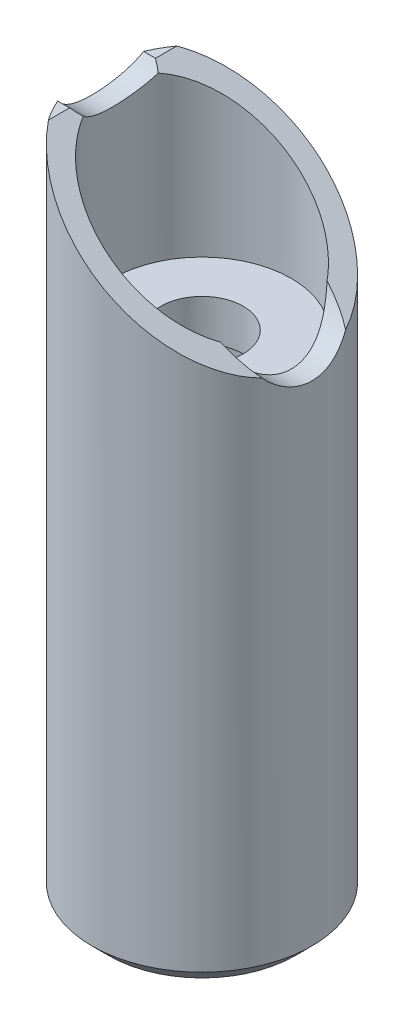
ISO-10303-21;
HEADER;
FILE_DESCRIPTION(('STEP AP214'),'2;1');
FILE_NAME('part.step','',(''),(''),'','','');
FILE_SCHEMA(('AUTOMOTIVE_DESIGN { 1 0 10303 214 1 1 1 1 }'));
ENDSEC;
DATA;
#1=APPLICATION_CONTEXT('core data for automotive mechanical design processes');
#2=APPLICATION_PROTOCOL_DEFINITION('international standard','automotive_design',2000,#1);
#3=PRODUCT_CONTEXT('',#1,'mechanical');
#4=PRODUCT('Part','Part','',(#3));
#5=PRODUCT_RELATED_PRODUCT_CATEGORY('part','',(#4));
#6=PRODUCT_DEFINITION_FORMATION('','',#4);
#7=PRODUCT_DEFINITION_CONTEXT('part definition',#1,'design');
#8=PRODUCT_DEFINITION('design','',#6,#7);
#9=PRODUCT_DEFINITION_SHAPE('','',#8);
#10=(LENGTH_UNIT() NAMED_UNIT(*) SI_UNIT(.MILLI.,.METRE.));
#11=(NAMED_UNIT(*) PLANE_ANGLE_UNIT() SI_UNIT($,.RADIAN.));
#12=(NAMED_UNIT(*) SI_UNIT($,.STERADIAN.) SOLID_ANGLE_UNIT());
#13=UNCERTAINTY_MEASURE_WITH_UNIT(LENGTH_MEASURE(1.E-05),#10,'distance_accuracy_value','');
#14=(GEOMETRIC_REPRESENTATION_CONTEXT(3) GLOBAL_UNCERTAINTY_ASSIGNED_CONTEXT((#13)) GLOBAL_UNIT_ASSIGNED_CONTEXT((#10,
#11,#12)) REPRESENTATION_CONTEXT('',''));
#15=CARTESIAN_POINT('',(0.,0.,0.));
#16=DIRECTION('',(0.,0.,1.));
#17=DIRECTION('',(1.,0.,0.));
#18=AXIS2_PLACEMENT_3D('',#15,#16,#17);
#19=CARTESIAN_POINT('',(-7.36545993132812,48.3,-3.1224989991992));
#20=DIRECTION('',(0.,1.,0.));
#21=DIRECTION('',(1.,0.,0.));
#22=AXIS2_PLACEMENT_3D('',#19,#20,#21);
#23=PLANE('',#22);
#24=CARTESIAN_POINT('',(0.,48.3,0.));
#25=DIRECTION('',(0.,1.,0.));
#26=DIRECTION('',(-0.8125,0.,-0.582961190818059));
#27=AXIS2_PLACEMENT_3D('',#24,#25,#26);
#28=CIRCLE('',#27,8.);
#29=CARTESIAN_POINT('',(-7.36545993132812,48.3,-3.1224989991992));
#30=VERTEX_POINT('',#29);
#31=CARTESIAN_POINT('',(-6.5,48.3,-4.66368952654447));
#32=VERTEX_POINT('',#31);
#33=EDGE_CURVE('E89',#30,#32,#28,.F.);
#34=ORIENTED_EDGE('',*,*,#33,.F.);
#35=DIRECTION('',(1.,0.,0.));
#36=VECTOR('',#35,1.);
#37=CARTESIAN_POINT('',(-7.36545993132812,48.3,-3.1224989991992));
#38=LINE('',#37,#36);
#39=CARTESIAN_POINT('',(-6.5,48.3,-3.1224989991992));
#40=VERTEX_POINT('',#39);
#41=EDGE_CURVE('E103',#30,#40,#38,.T.);
#42=ORIENTED_EDGE('',*,*,#41,.T.);
#43=DIRECTION('',(0.,0.,-1.));
#44=VECTOR('',#43,1.);
#45=CARTESIAN_POINT('',(-6.5,48.3,-3.1224989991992));
#46=LINE('',#45,#44);
#47=EDGE_CURVE('E105',#40,#32,#46,.T.);
#48=ORIENTED_EDGE('',*,*,#47,.T.);
#49=EDGE_LOOP('',(#34,#42,#48));
#50=FACE_BOUND('',#49,.T.);
#51=ADVANCED_FACE('F15',(#50),#23,.T.);
#52=CARTESIAN_POINT('',(7.39950060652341,38.2014216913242,-8.));
#53=DIRECTION('',(0.587785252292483,0.809016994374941,0.));
#54=DIRECTION('',(-0.809016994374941,0.587785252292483,0.));
#55=AXIS2_PLACEMENT_3D('',#52,#53,#54);
#56=PLANE('',#55);
#57=CARTESIAN_POINT('',(-5.90371291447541,47.8667720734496,-2.71959076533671));
#58=CARTESIAN_POINT('',(-5.9269169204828,47.8836307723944,-2.73777365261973));
#59=CARTESIAN_POINT('',(-5.95024469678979,47.9005793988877,-2.75571470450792));
#60=CARTESIAN_POINT('',(-5.99734513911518,47.9347998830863,-2.79127979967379));
#61=CARTESIAN_POINT('',(-6.02111991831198,47.9520732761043,-2.80889956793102));
#62=CARTESIAN_POINT('',(-6.06910790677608,47.9869385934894,-2.84381778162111));
#63=CARTESIAN_POINT('',(-6.09332313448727,48.0045319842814,-2.86111198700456));
#64=CARTESIAN_POINT('',(-6.14218577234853,48.0400327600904,-2.89537471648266));
#65=CARTESIAN_POINT('',(-6.16683511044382,48.0579415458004,-2.91233903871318));
#66=CARTESIAN_POINT('',(-6.21655965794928,48.0940685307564,-2.94593765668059));
#67=CARTESIAN_POINT('',(-6.24163670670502,48.1122880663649,-2.96256779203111));
#68=CARTESIAN_POINT('',(-6.29221038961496,48.149031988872,-2.99549367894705));
#69=CARTESIAN_POINT('',(-6.31770877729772,48.1675576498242,-3.01178531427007));
#70=CARTESIAN_POINT('',(-6.3691188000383,48.2049092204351,-3.04402985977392));
#71=CARTESIAN_POINT('',(-6.39503210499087,48.2237363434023,-3.05997870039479));
#72=CARTESIAN_POINT('',(-6.44726579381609,48.2616863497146,-3.09153322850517));
#73=CARTESIAN_POINT('',(-6.473587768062,48.2808103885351,-3.10713489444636));
#74=CARTESIAN_POINT('',(-6.5,48.3,-3.12249899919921));
#75=B_SPLINE_CURVE_WITH_KNOTS('',3,(#57,#58,#59,#60,#61,#62,#63,#64,#65,#66,#67,#68,#69,#70,#71,
#72,#73,#74),.UNSPECIFIED.,.F.,.F.,(4,2,2,2,2,2,2,2,4),(0.,0.101877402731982,0.20466671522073,
0.308368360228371,0.412982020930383,0.51850667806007,0.624940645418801,0.732281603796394,
0.840526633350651),.UNSPECIFIED.);
#76=CARTESIAN_POINT('',(-5.90371291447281,47.8667720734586,-2.71959076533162));
#77=VERTEX_POINT('',#76);
#78=EDGE_CURVE('E109',#77,#40,#75,.T.);
#79=ORIENTED_EDGE('',*,*,#78,.F.);
#80=CARTESIAN_POINT('',(-5.90371291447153,47.8667720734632,-2.71959076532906));
#81=CARTESIAN_POINT('',(-5.47552346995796,47.5556742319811,-3.64910838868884));
#82=CARTESIAN_POINT('',(-4.83416210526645,47.0896979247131,-4.46551084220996));
#83=CARTESIAN_POINT('',(-3.62179757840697,46.2088635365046,-5.42194542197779));
#84=CARTESIAN_POINT('',(-3.19285806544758,45.8972207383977,-5.68354072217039));
#85=CARTESIAN_POINT('',(-2.02977480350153,45.0521912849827,-6.22476835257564));
#86=CARTESIAN_POINT('',(-1.2506646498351,44.4861346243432,-6.43314867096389));
#87=CARTESIAN_POINT('',(-0.27913859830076,43.7802796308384,-6.49555023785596));
#88=CARTESIAN_POINT('',(-0.139732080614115,43.6789948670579,-6.50000000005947));
#89=CARTESIAN_POINT('',(0.,43.5774735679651,-6.5));
#90=B_SPLINE_CURVE_WITH_KNOTS('',3,(#80,#81,#82,#83,#84,#85,#86,#87,#88,#89),.UNSPECIFIED.,.F.,
.F.,(4,2,2,2,4),(0.,0.413134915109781,0.619675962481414,0.94555483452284,1.),.UNSPECIFIED.);
#91=CARTESIAN_POINT('',(0.,43.5774735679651,-6.5));
#92=VERTEX_POINT('',#91);
#93=EDGE_CURVE('E178',#77,#92,#90,.T.);
#94=ORIENTED_EDGE('',*,*,#93,.T.);
#95=CARTESIAN_POINT('',(0.,43.5774735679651,-6.5));
#96=CARTESIAN_POINT('',(0.482335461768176,43.2270363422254,-6.49999998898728));
#97=CARTESIAN_POINT('',(0.960791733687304,42.8794175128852,-6.44697958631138));
#98=CARTESIAN_POINT('',(1.97980347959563,42.1390621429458,-6.21627663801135));
#99=CARTESIAN_POINT('',(2.50223298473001,41.7594948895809,-6.02519895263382));
#100=CARTESIAN_POINT('',(3.72954784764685,40.8677984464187,-5.38691012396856));
#101=CARTESIAN_POINT('',(4.36511626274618,40.406030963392,-4.88091172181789));
#102=CARTESIAN_POINT('',(5.00635197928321,39.9401459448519,-4.14967674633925));
#103=CARTESIAN_POINT('',(5.11903782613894,39.8582748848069,-4.00952625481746));
#104=CARTESIAN_POINT('',(5.22356691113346,39.7823300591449,-3.86837804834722));
#105=B_SPLINE_CURVE_WITH_KNOTS('',3,(#95,#96,#97,#98,#99,#100,#101,#102,#103,#104),
.UNSPECIFIED.,.F.,.F.,(4,2,2,2,4),(0.,0.23731643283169,0.509674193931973,0.907796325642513,1.),.UNSPECIFIED.);
#106=CARTESIAN_POINT('',(5.22356691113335,39.78233006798,-3.86837801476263));
#107=VERTEX_POINT('',#106);
#108=EDGE_CURVE('E172',#92,#107,#105,.T.);
#109=ORIENTED_EDGE('',*,*,#108,.T.);
#110=CARTESIAN_POINT('',(5.22356691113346,39.7823300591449,-3.86837804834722));
#111=CARTESIAN_POINT('',(6.02953486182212,39.1967600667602,-3.71432971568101));
#112=CARTESIAN_POINT('',(6.77162245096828,38.6576018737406,-3.43077094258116));
#113=CARTESIAN_POINT('',(7.39950057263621,38.2014217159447,-3.04095230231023));
#114=B_SPLINE_CURVE_WITH_KNOTS('',3,(#110,#111,#112,#113),.UNSPECIFIED.,.F.,.F.,(4,4),(0.,1.),.UNSPECIFIED.);
#115=CARTESIAN_POINT('',(7.39950057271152,38.2014217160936,-3.04095230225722));
#116=VERTEX_POINT('',#115);
#117=EDGE_CURVE('E169',#107,#116,#114,.T.);
#118=ORIENTED_EDGE('',*,*,#117,.T.);
#119=CARTESIAN_POINT('',(7.39950057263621,38.2014217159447,-3.04095230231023));
#120=CARTESIAN_POINT('',(6.88075327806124,38.5783136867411,-4.30321180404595));
#121=CARTESIAN_POINT('',(6.04921994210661,39.1824580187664,-5.41753198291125));
#122=CARTESIAN_POINT('',(4.42877796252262,40.3597780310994,-6.6958989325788));
#123=CARTESIAN_POINT('',(3.86592940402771,40.7687114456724,-7.03401570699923));
#124=CARTESIAN_POINT('',(2.38669503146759,41.8434381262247,-7.69722399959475));
#125=CARTESIAN_POINT('',(1.42072453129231,42.5452567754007,-7.93881663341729));
#126=CARTESIAN_POINT('',(0.269137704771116,43.3819335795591,-7.99664068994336));
#127=CARTESIAN_POINT('',(0.134691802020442,43.4796142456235,-7.99999999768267));
#128=CARTESIAN_POINT('',(1.18654292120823E-07,43.5774734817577,-8.));
#129=B_SPLINE_CURVE_WITH_KNOTS('',3,(#119,#120,#121,#122,#123,#124,#125,#126,#127,#128),
.UNSPECIFIED.,.F.,.F.,(4,2,2,2,4),(0.,0.436605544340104,0.646535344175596,0.958809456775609,1.),.UNSPECIFIED.);
#130=CARTESIAN_POINT('',(1.05885572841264E-07,43.577473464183,-8.));
#131=VERTEX_POINT('',#130);
#132=EDGE_CURVE('E170',#116,#131,#129,.T.);
#133=ORIENTED_EDGE('',*,*,#132,.T.);
#134=CARTESIAN_POINT('',(1.18654292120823E-07,43.5774734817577,-8.));
#135=CARTESIAN_POINT('',(-0.593643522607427,44.0087808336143,-8.));
#136=CARTESIAN_POINT('',(-1.18251277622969,44.4366193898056,-7.93474413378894));
#137=CARTESIAN_POINT('',(-2.43668110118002,45.3478260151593,-7.65080206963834));
#138=CARTESIAN_POINT('',(-3.07967128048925,45.8149857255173,-7.41562954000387));
#139=CARTESIAN_POINT('',(-4.59021264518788,46.9124582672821,-6.63004332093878));
#140=CARTESIAN_POINT('',(-5.37245067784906,47.4807874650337,-6.00727608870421));
#141=CARTESIAN_POINT('',(-6.18800393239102,48.0733215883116,-5.07725763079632));
#142=CARTESIAN_POINT('',(-6.35020700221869,48.1911690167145,-4.87246295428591));
#143=CARTESIAN_POINT('',(-6.49999999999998,48.3,-4.66368952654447));
#144=B_SPLINE_CURVE_WITH_KNOTS('',3,(#134,#135,#136,#137,#138,#139,#140,#141,#142,#143),
.UNSPECIFIED.,.F.,.F.,(4,2,2,2,4),(0.,0.233495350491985,0.501467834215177,0.893179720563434,1.),.UNSPECIFIED.);
#145=EDGE_CURVE('E177',#131,#32,#144,.T.);
#146=ORIENTED_EDGE('',*,*,#145,.T.);
#147=ORIENTED_EDGE('',*,*,#47,.F.);
#148=EDGE_LOOP('',(#79,#94,#109,#118,#133,#146,#147));
#149=FACE_BOUND('',#148,.T.);
#150=ADVANCED_FACE('F127',(#149),#56,.T.);
#151=CARTESIAN_POINT('',(-7.36545993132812,48.3,4.66368986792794));
#152=DIRECTION('',(0.,1.,0.));
#153=DIRECTION('',(1.,0.,0.));
#154=AXIS2_PLACEMENT_3D('',#151,#152,#153);
#155=PLANE('',#154);
#156=DIRECTION('',(-1.58928742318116E-07,0.,-0.999999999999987));
#157=VECTOR('',#156,1.);
#158=CARTESIAN_POINT('',(-6.49999975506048,48.3,4.66368986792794));
#159=LINE('',#158,#157);
#160=CARTESIAN_POINT('',(-6.49999975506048,48.3,4.66368986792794));
#161=VERTEX_POINT('',#160);
#162=CARTESIAN_POINT('',(-6.5,48.3,3.1224989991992));
#163=VERTEX_POINT('',#162);
#164=EDGE_CURVE('E332',#161,#163,#159,.T.);
#165=ORIENTED_EDGE('',*,*,#164,.T.);
#166=DIRECTION('',(-1.,0.,0.));
#167=VECTOR('',#166,1.);
#168=CARTESIAN_POINT('',(-6.5,48.3,3.1224989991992));
#169=LINE('',#168,#167);
#170=CARTESIAN_POINT('',(-7.36545993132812,48.3,3.12249899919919));
#171=VERTEX_POINT('',#170);
#172=EDGE_CURVE('E285',#163,#171,#169,.T.);
#173=ORIENTED_EDGE('',*,*,#172,.T.);
#174=CARTESIAN_POINT('',(0.,48.3,0.));
#175=DIRECTION('',(0.,1.,0.));
#176=DIRECTION('',(-0.920682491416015,0.,0.3903123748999));
#177=AXIS2_PLACEMENT_3D('',#174,#175,#176);
#178=CIRCLE('',#177,8.);
#179=EDGE_CURVE('E92',#161,#171,#178,.F.);
#180=ORIENTED_EDGE('',*,*,#179,.F.);
#181=EDGE_LOOP('',(#165,#173,#180));
#182=FACE_BOUND('',#181,.T.);
#183=ADVANCED_FACE('F137',(#182),#155,.T.);
#184=CARTESIAN_POINT('',(-6.95806516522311,0.,-6.773));
#185=DIRECTION('',(0.,-1.,0.));
#186=DIRECTION('',(1.,0.,0.));
#187=AXIS2_PLACEMENT_3D('',#184,#185,#186);
#188=PLANE('',#187);
#189=CARTESIAN_POINT('',(0.,0.,0.));
#190=DIRECTION('',(0.,-1.,0.));
#191=DIRECTION('',(0.,0.,1.));
#192=AXIS2_PLACEMENT_3D('',#189,#190,#191);
#193=CIRCLE('',#192,6.773);
#194=CARTESIAN_POINT('',(0.,0.,6.773));
#195=VERTEX_POINT('',#194);
#196=EDGE_CURVE('E333',#195,#195,#193,.T.);
#197=ORIENTED_EDGE('',*,*,#196,.T.);
#198=EDGE_LOOP('',(#197));
#199=FACE_BOUND('',#198,.T.);
#200=CARTESIAN_POINT('',(0.,0.,0.));
#201=DIRECTION('',(0.,1.,0.));
#202=DIRECTION('',(0.,0.,-1.));
#203=AXIS2_PLACEMENT_3D('',#200,#201,#202);
#204=CIRCLE('',#203,5.);
#205=CARTESIAN_POINT('',(0.,0.,-5.));
#206=VERTEX_POINT('',#205);
#207=EDGE_CURVE('E287',#206,#206,#204,.F.);
#208=ORIENTED_EDGE('',*,*,#207,.F.);
#209=EDGE_LOOP('',(#208));
#210=FACE_BOUND('',#209,.T.);
#211=ADVANCED_FACE('F253',(#199,#210),#188,.T.);
#212=CARTESIAN_POINT('',(7.39950060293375,38.2014216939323,2.71959081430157));
#213=DIRECTION('',(0.587785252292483,0.809016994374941,0.));
#214=DIRECTION('',(-0.809016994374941,0.587785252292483,0.));
#215=AXIS2_PLACEMENT_3D('',#212,#213,#214);
#216=PLANE('',#215);
#217=CARTESIAN_POINT('',(-6.5,48.3,3.1224989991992));
#218=CARTESIAN_POINT('',(-6.47358776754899,48.280810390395,3.10713489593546));
#219=CARTESIAN_POINT('',(-6.44726579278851,48.2616863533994,3.09153323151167));
#220=CARTESIAN_POINT('',(-6.39503210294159,48.2237363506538,3.05997870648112));
#221=CARTESIAN_POINT('',(-6.36911879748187,48.2049092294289,3.04402986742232));
#222=CARTESIAN_POINT('',(-6.3177087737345,48.1675576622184,3.01178532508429));
#223=CARTESIAN_POINT('',(-6.29221038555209,48.1490320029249,2.99549369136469));
#224=CARTESIAN_POINT('',(-6.2416367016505,48.1122880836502,2.96256780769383));
#225=CARTESIAN_POINT('',(-6.21655965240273,48.0940685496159,2.94593767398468));
#226=CARTESIAN_POINT('',(-6.16683510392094,48.0579415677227,2.91233905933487));
#227=CARTESIAN_POINT('',(-6.14218576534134,48.0400327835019,2.89537473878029));
#228=CARTESIAN_POINT('',(-6.09332312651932,48.0045320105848,2.86111201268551));
#229=CARTESIAN_POINT('',(-6.06910789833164,47.9869386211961,2.84381780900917));
#230=CARTESIAN_POINT('',(-6.02111990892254,47.9520733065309,2.80889959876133));
#231=CARTESIAN_POINT('',(-5.99734512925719,47.9347999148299,2.79127983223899));
#232=CARTESIAN_POINT('',(-5.95024468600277,47.9005794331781,2.75571474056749));
#233=CARTESIAN_POINT('',(-5.92691690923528,47.8836308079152,2.73777369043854));
#234=CARTESIAN_POINT('',(-5.9037129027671,47.8667721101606,2.71959080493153));
#235=B_SPLINE_CURVE_WITH_KNOTS('',3,(#217,#218,#219,#220,#221,#222,#223,#224,#225,#226,#227,
#228,#229,#230,#231,#232,#233,#234),.UNSPECIFIED.,.F.,.F.,(4,2,2,2,2,2,2,2,4),(0.,
0.108245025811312,0.215585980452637,0.322019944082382,0.427544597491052,0.53215825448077,
0.635859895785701,0.738649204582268,0.840526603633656),.UNSPECIFIED.);
#236=CARTESIAN_POINT('',(-5.90371291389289,47.8667720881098,2.71959081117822));
#237=VERTEX_POINT('',#236);
#238=EDGE_CURVE('E280',#163,#237,#235,.T.);
#239=ORIENTED_EDGE('',*,*,#238,.F.);
#240=ORIENTED_EDGE('',*,*,#164,.F.);
#241=CARTESIAN_POINT('',(-6.49999988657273,48.2999999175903,4.66368986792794));
#242=CARTESIAN_POINT('',(-6.05438028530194,47.9762383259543,5.28477041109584));
#243=CARTESIAN_POINT('',(-5.5335796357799,47.5978545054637,5.82432076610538));
#244=CARTESIAN_POINT('',(-4.3440126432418,46.7335834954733,6.7627703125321));
#245=CARTESIAN_POINT('',(-3.67030629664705,46.2441071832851,7.15171776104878));
#246=CARTESIAN_POINT('',(-2.47239168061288,45.373771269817,7.62510434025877));
#247=CARTESIAN_POINT('',(-1.9899538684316,45.0232596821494,7.76486903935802));
#248=CARTESIAN_POINT('',(-1.00592544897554,44.3083211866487,7.95231685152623));
#249=CARTESIAN_POINT('',(-0.50433484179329,43.9438942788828,7.99999996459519));
#250=CARTESIAN_POINT('',(-4.12728476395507E-07,43.5774738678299,8.00000000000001));
#251=B_SPLINE_CURVE_WITH_KNOTS('',3,(#241,#242,#243,#244,#245,#246,#247,#248,#249,#250),
.UNSPECIFIED.,.F.,.F.,(4,2,2,2,4),(0.,0.294089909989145,0.604584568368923,0.802292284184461,1.),.UNSPECIFIED.);
#252=CARTESIAN_POINT('',(-3.64113747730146E-07,43.5774739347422,8.));
#253=VERTEX_POINT('',#252);
#254=EDGE_CURVE('E286',#161,#253,#251,.T.);
#255=ORIENTED_EDGE('',*,*,#254,.T.);
#256=CARTESIAN_POINT('',(-4.12728476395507E-07,43.5774738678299,8.00000000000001));
#257=CARTESIAN_POINT('',(0.593643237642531,43.146166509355,7.99999998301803));
#258=CARTESIAN_POINT('',(1.18251250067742,42.7183279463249,7.93474409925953));
#259=CARTESIAN_POINT('',(2.43668093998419,41.8071212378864,7.65080197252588));
#260=CARTESIAN_POINT('',(3.07967120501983,41.3399614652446,7.41562937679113));
#261=CARTESIAN_POINT('',(4.59021264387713,40.2424888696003,6.63004300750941));
#262=CARTESIAN_POINT('',(5.37245069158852,39.6741596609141,6.00727569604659));
#263=CARTESIAN_POINT('',(6.58690556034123,38.7918065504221,4.62236852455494));
#264=CARTESIAN_POINT('',(7.05550407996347,38.4513497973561,3.87799299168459));
#265=CARTESIAN_POINT('',(7.39950060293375,38.2014216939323,3.04095182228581));
#266=B_SPLINE_CURVE_WITH_KNOTS('',3,(#256,#257,#258,#259,#260,#261,#262,#263,#264,#265),
.UNSPECIFIED.,.F.,.F.,(4,2,2,2,4),(0.,0.187721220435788,0.40316075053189,0.718081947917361,1.),.UNSPECIFIED.);
#267=CARTESIAN_POINT('',(7.39950063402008,38.2014216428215,3.04095193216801));
#268=VERTEX_POINT('',#267);
#269=EDGE_CURVE('E234',#253,#268,#266,.T.);
#270=ORIENTED_EDGE('',*,*,#269,.T.);
#271=CARTESIAN_POINT('',(7.39950060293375,38.2014216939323,3.04095182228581));
#272=CARTESIAN_POINT('',(6.77162243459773,38.6576018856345,3.43077061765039));
#273=CARTESIAN_POINT('',(6.02953483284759,39.1967600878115,3.71432953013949));
#274=CARTESIAN_POINT('',(5.22356690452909,39.7823300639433,3.86837799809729));
#275=B_SPLINE_CURVE_WITH_KNOTS('',3,(#271,#272,#273,#274),.UNSPECIFIED.,.F.,.F.,(4,4),(0.,1.),.UNSPECIFIED.);
#276=CARTESIAN_POINT('',(5.22356690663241,39.7823300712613,3.86837798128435));
#277=VERTEX_POINT('',#276);
#278=EDGE_CURVE('E221',#268,#277,#275,.T.);
#279=ORIENTED_EDGE('',*,*,#278,.T.);
#280=CARTESIAN_POINT('',(5.22356690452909,39.7823300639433,3.86837799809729));
#281=CARTESIAN_POINT('',(4.87324563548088,40.0368533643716,4.34142547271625));
#282=CARTESIAN_POINT('',(4.47024944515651,40.3296472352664,4.75260148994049));
#283=CARTESIAN_POINT('',(3.5421866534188,41.0039243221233,5.48475041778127));
#284=CARTESIAN_POINT('',(3.01206384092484,41.3890810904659,5.79284421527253));
#285=CARTESIAN_POINT('',(2.05578405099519,42.0838590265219,6.18048685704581));
#286=CARTESIAN_POINT('',(1.65657548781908,42.3739010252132,6.29933265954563));
#287=CARTESIAN_POINT('',(0.839550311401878,42.9675045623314,6.45908922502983));
#288=CARTESIAN_POINT('',(0.421733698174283,43.2710661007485,6.49999998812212));
#289=CARTESIAN_POINT('',(0.,43.5774735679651,6.50000000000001));
#290=B_SPLINE_CURVE_WITH_KNOTS('',3,(#280,#281,#282,#283,#284,#285,#286,#287,#288,#289),
.UNSPECIFIED.,.F.,.F.,(4,2,2,2,4),(0.,0.281484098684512,0.587884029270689,0.793942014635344,1.),.UNSPECIFIED.);
#291=CARTESIAN_POINT('',(0.,43.5774735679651,6.5));
#292=VERTEX_POINT('',#291);
#293=EDGE_CURVE('E41',#277,#292,#290,.T.);
#294=ORIENTED_EDGE('',*,*,#293,.T.);
#295=CARTESIAN_POINT('',(0.,43.5774735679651,6.50000000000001));
#296=CARTESIAN_POINT('',(-0.482335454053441,43.9279107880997,6.50000000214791));
#297=CARTESIAN_POINT('',(-0.960791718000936,44.2755296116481,6.44697961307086));
#298=CARTESIAN_POINT('',(-1.97980344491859,45.01588496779,6.21627669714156));
#299=CARTESIAN_POINT('',(-2.50223293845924,45.3954522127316,6.02519903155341));
#300=CARTESIAN_POINT('',(-3.72954776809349,46.2871486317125,5.38691025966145));
#301=CARTESIAN_POINT('',(-4.36511615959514,46.7489160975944,4.88091189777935));
#302=CARTESIAN_POINT('',(-5.294098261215,47.4238611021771,3.82154453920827));
#303=CARTESIAN_POINT('',(-5.63669124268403,47.6727694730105,3.29924394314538));
#304=CARTESIAN_POINT('',(-5.90371291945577,47.8667720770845,2.71959081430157));
#305=B_SPLINE_CURVE_WITH_KNOTS('',3,(#295,#296,#297,#298,#299,#300,#301,#302,#303,#304),
.UNSPECIFIED.,.F.,.F.,(4,2,2,2,4),(0.,0.194517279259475,0.41775631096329,0.744078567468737,1.),.UNSPECIFIED.);
#306=EDGE_CURVE('E220',#292,#237,#305,.T.);
#307=ORIENTED_EDGE('',*,*,#306,.T.);
#308=EDGE_LOOP('',(#239,#240,#255,#270,#279,#294,#307));
#309=FACE_BOUND('',#308,.T.);
#310=ADVANCED_FACE('F232',(#309),#216,.T.);
#311=CARTESIAN_POINT('',(-6.67760572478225,36.,-6.5));
#312=DIRECTION('',(0.,1.,0.));
#313=DIRECTION('',(0.,0.,1.));
#314=AXIS2_PLACEMENT_3D('',#311,#312,#313);
#315=PLANE('',#314);
#316=CARTESIAN_POINT('',(0.,36.,0.));
#317=DIRECTION('',(0.,1.,0.));
#318=DIRECTION('',(0.,0.,-1.));
#319=AXIS2_PLACEMENT_3D('',#316,#317,#318);
#320=CIRCLE('',#319,6.5);
#321=CARTESIAN_POINT('',(0.,36.,-6.5));
#322=VERTEX_POINT('',#321);
#323=EDGE_CURVE('E282',#322,#322,#320,.F.);
#324=ORIENTED_EDGE('',*,*,#323,.F.);
#325=EDGE_LOOP('',(#324));
#326=FACE_BOUND('',#325,.T.);
#327=CARTESIAN_POINT('',(0.,36.,0.));
#328=DIRECTION('',(0.,-1.,0.));
#329=DIRECTION('',(0.,0.,1.));
#330=AXIS2_PLACEMENT_3D('',#327,#328,#329);
#331=CIRCLE('',#330,3.);
#332=CARTESIAN_POINT('',(0.,36.,3.));
#333=VERTEX_POINT('',#332);
#334=EDGE_CURVE('E464',#333,#333,#331,.T.);
#335=ORIENTED_EDGE('',*,*,#334,.T.);
#336=EDGE_LOOP('',(#335));
#337=FACE_BOUND('',#336,.T.);
#338=ADVANCED_FACE('F252',(#326,#337),#315,.T.);
#339=CARTESIAN_POINT('',(-4.99999975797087,33.,5.0000003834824));
#340=DIRECTION('',(0.,-1.,0.));
#341=DIRECTION('',(0.,0.,-1.));
#342=AXIS2_PLACEMENT_3D('',#339,#340,#341);
#343=PLANE('',#342);
#344=CARTESIAN_POINT('',(0.,33.,0.));
#345=DIRECTION('',(0.,-1.,0.));
#346=DIRECTION('',(-1.41914861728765E-07,0.,1.));
#347=AXIS2_PLACEMENT_3D('',#344,#345,#346);
#348=CIRCLE('',#347,5.);
#349=CARTESIAN_POINT('',(-7.09574308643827E-07,33.,5.));
#350=VERTEX_POINT('',#349);
#351=EDGE_CURVE('E466',#350,#350,#348,.T.);
#352=ORIENTED_EDGE('',*,*,#351,.T.);
#353=EDGE_LOOP('',(#352));
#354=FACE_BOUND('',#353,.T.);
#355=CARTESIAN_POINT('',(0.,33.,0.));
#356=DIRECTION('',(0.,1.,0.));
#357=DIRECTION('',(0.,0.,-1.));
#358=AXIS2_PLACEMENT_3D('',#355,#356,#357);
#359=CIRCLE('',#358,3.);
#360=CARTESIAN_POINT('',(0.,33.,-3.));
#361=VERTEX_POINT('',#360);
#362=EDGE_CURVE('E461',#361,#361,#359,.F.);
#363=ORIENTED_EDGE('',*,*,#362,.F.);
#364=EDGE_LOOP('',(#363));
#365=FACE_BOUND('',#364,.T.);
#366=ADVANCED_FACE('F395',(#354,#365),#343,.T.);
#367=CARTESIAN_POINT('',(9.,40.8,0.));
#368=DIRECTION('',(-1.,0.,0.));
#369=DIRECTION('',(0.,-0.254416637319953,-0.967094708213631));
#370=AXIS2_PLACEMENT_3D('',#367,#368,#369);
#371=CYLINDRICAL_SURFACE('',#370,4.);
#372=CARTESIAN_POINT('',(7.39950069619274,38.2014215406,3.04095215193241));
#373=CARTESIAN_POINT('',(7.41003530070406,38.1714240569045,3.01531845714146));
#374=CARTESIAN_POINT('',(7.42059354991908,38.1418106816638,2.98924502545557));
#375=CARTESIAN_POINT('',(7.44172407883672,38.0833708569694,2.93623609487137));
#376=CARTESIAN_POINT('',(7.45229635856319,38.0545444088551,2.90930059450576));
#377=CARTESIAN_POINT('',(7.47342162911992,37.9976973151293,2.85458508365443));
#378=CARTESIAN_POINT('',(7.48397461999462,37.9696766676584,2.82680507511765));
#379=CARTESIAN_POINT('',(7.50502800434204,37.9144600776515,2.7704180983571));
#380=CARTESIAN_POINT('',(7.51552839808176,37.8872641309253,2.74181113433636));
#381=CARTESIAN_POINT('',(7.53644324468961,37.833715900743,2.68378783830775));
#382=CARTESIAN_POINT('',(7.54685769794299,37.8073636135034,2.65437150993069));
#383=CARTESIAN_POINT('',(7.56756744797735,37.7555217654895,2.59474718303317));
#384=CARTESIAN_POINT('',(7.57786274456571,37.7300322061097,2.56453918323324));
#385=CARTESIAN_POINT('',(7.59830049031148,37.6799349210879,2.50334923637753));
#386=CARTESIAN_POINT('',(7.60844293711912,37.6553272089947,2.47236727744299));
#387=CARTESIAN_POINT('',(7.62854306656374,37.607013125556,2.40964767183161));
#388=CARTESIAN_POINT('',(7.63850074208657,37.583306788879,2.37790999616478));
#389=CARTESIAN_POINT('',(7.65819076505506,37.5368187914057,2.31370246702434));
#390=CARTESIAN_POINT('',(7.6679231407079,37.5140370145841,2.28123270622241));
#391=CARTESIAN_POINT('',(7.68713090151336,37.4694220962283,2.21558691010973));
#392=CARTESIAN_POINT('',(7.69660635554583,37.4475886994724,2.18241106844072));
#393=CARTESIAN_POINT('',(7.71527490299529,37.404891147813,2.11537577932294));
#394=CARTESIAN_POINT('',(7.72446806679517,37.3840267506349,2.08151650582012));
#395=CARTESIAN_POINT('',(7.74254543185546,37.3432874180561,2.01313726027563));
#396=CARTESIAN_POINT('',(7.75142970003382,37.3234122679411,1.9786174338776));
#397=CARTESIAN_POINT('',(7.76886289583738,37.2846714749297,1.90894054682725));
#398=CARTESIAN_POINT('',(7.77741187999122,37.2658056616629,1.87378359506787));
#399=CARTESIAN_POINT('',(7.79414849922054,37.2291033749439,1.8028565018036));
#400=CARTESIAN_POINT('',(7.80233617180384,37.2112667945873,1.76708642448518));
#401=CARTESIAN_POINT('',(7.81832434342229,37.1766385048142,1.69494910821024));
#402=CARTESIAN_POINT('',(7.82612476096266,37.1598470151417,1.65858174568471));
#403=CARTESIAN_POINT('',(7.84134529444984,37.1272891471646,1.58518496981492));
#404=CARTESIAN_POINT('',(7.84876427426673,37.1115257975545,1.54815397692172));
#405=CARTESIAN_POINT('',(7.86319463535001,37.0810132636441,1.47335599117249));
#406=CARTESIAN_POINT('',(7.87020358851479,37.0662700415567,1.43558609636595));
#407=CARTESIAN_POINT('',(7.88378860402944,37.037802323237,1.35924287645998));
#408=CARTESIAN_POINT('',(7.89036087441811,37.0240866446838,1.32066558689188));
#409=CARTESIAN_POINT('',(7.90304632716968,36.9976896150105,1.24263796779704));
#410=CARTESIAN_POINT('',(7.90915418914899,36.9850201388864,1.20318275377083));
#411=CARTESIAN_POINT('',(7.92088523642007,36.9607427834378,1.12332858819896));
#412=CARTESIAN_POINT('',(7.92650145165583,36.9491500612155,1.0829240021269));
#413=CARTESIAN_POINT('',(7.93722293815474,36.9270656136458,1.00110000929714));
#414=CARTESIAN_POINT('',(7.94231948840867,36.9165925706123,0.959674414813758));
#415=CARTESIAN_POINT('',(7.9519367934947,36.8968844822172,0.876098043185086));
#416=CARTESIAN_POINT('',(7.95645245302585,36.887660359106,0.833944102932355));
#417=CARTESIAN_POINT('',(7.96480807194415,36.8706440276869,0.749662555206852));
#418=CARTESIAN_POINT('',(7.96865350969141,36.8628401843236,0.707537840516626));
#419=CARTESIAN_POINT('',(7.97566811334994,36.8486409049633,0.623352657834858));
#420=CARTESIAN_POINT('',(7.97884255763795,36.8422344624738,0.58129448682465));
#421=CARTESIAN_POINT('',(7.98451979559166,36.830802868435,0.497252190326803));
#422=CARTESIAN_POINT('',(7.9870272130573,36.825768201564,0.455269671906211));
#423=CARTESIAN_POINT('',(7.99137459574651,36.8170564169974,0.371386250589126));
#424=CARTESIAN_POINT('',(7.99321849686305,36.8133712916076,0.329486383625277));
#425=CARTESIAN_POINT('',(7.99624320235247,36.8073382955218,0.245774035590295));
#426=CARTESIAN_POINT('',(7.9974272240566,36.8049839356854,0.203962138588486));
#427=CARTESIAN_POINT('',(7.99913652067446,36.801595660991,0.120430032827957));
#428=CARTESIAN_POINT('',(7.99966427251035,36.8005567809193,0.0787100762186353));
#429=CARTESIAN_POINT('',(8.00006540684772,36.7997861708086,-0.00463496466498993));
#430=CARTESIAN_POINT('',(7.99994051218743,36.800050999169,-0.0462600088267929));
#431=CARTESIAN_POINT('',(7.99904073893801,36.8018780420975,-0.129412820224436));
#432=CARTESIAN_POINT('',(7.99826682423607,36.8034383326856,-0.170940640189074));
#433=CARTESIAN_POINT('',(7.99607339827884,36.807850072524,-0.253897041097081));
#434=CARTESIAN_POINT('',(7.99465409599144,36.8107011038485,-0.295325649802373));
#435=CARTESIAN_POINT('',(7.99117427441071,36.8176916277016,-0.378081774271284));
#436=CARTESIAN_POINT('',(7.98911322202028,36.821832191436,-0.419409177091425));
#437=CARTESIAN_POINT('',(7.98435426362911,36.831402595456,-0.50196081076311));
#438=CARTESIAN_POINT('',(7.98165510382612,36.8368349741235,-0.543184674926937));
#439=CARTESIAN_POINT('',(7.9756242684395,36.8489933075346,-0.625526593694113));
#440=CARTESIAN_POINT('',(7.97229064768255,36.8557232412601,-0.666643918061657));
#441=CARTESIAN_POINT('',(7.96499519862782,36.8704844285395,-0.748769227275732));
#442=CARTESIAN_POINT('',(7.96103077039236,36.8785210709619,-0.789776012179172));
#443=CARTESIAN_POINT('',(7.95247796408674,36.8959068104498,-0.871675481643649));
#444=CARTESIAN_POINT('',(7.94788637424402,36.9052626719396,-0.912566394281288));
#445=CARTESIAN_POINT('',(7.9380834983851,36.9253013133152,-0.994227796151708));
#446=CARTESIAN_POINT('',(7.93286843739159,36.935992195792,-1.03499584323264));
#447=CARTESIAN_POINT('',(7.9218226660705,36.958718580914,-1.11640325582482));
#448=CARTESIAN_POINT('',(7.91598766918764,36.9707634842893,-1.15703941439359));
#449=CARTESIAN_POINT('',(7.90370660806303,36.9962188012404,-1.23817262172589));
#450=CARTESIAN_POINT('',(7.89725580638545,37.0096398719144,-1.2786656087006));
#451=CARTESIAN_POINT('',(7.88374716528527,37.0378677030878,-1.35948873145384));
#452=CARTESIAN_POINT('',(7.87668431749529,37.0526860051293,-1.39981399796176));
#453=CARTESIAN_POINT('',(7.86204400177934,37.0835645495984,-1.47984643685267));
#454=CARTESIAN_POINT('',(7.85446702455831,37.0996236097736,-1.51955415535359));
#455=CARTESIAN_POINT('',(7.83886869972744,37.1328706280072,-1.598114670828));
#456=CARTESIAN_POINT('',(7.8308502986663,37.1500512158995,-1.63697117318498));
#457=CARTESIAN_POINT('',(7.81440023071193,37.1855063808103,-1.7138312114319));
#458=CARTESIAN_POINT('',(7.80597100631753,37.2037746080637,-1.75183820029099));
#459=CARTESIAN_POINT('',(7.78873108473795,37.2413736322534,-1.82700188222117));
#460=CARTESIAN_POINT('',(7.77992237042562,37.2606990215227,-1.86416173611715));
#461=CARTESIAN_POINT('',(7.76195501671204,37.3003842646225,-1.937634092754));
#462=CARTESIAN_POINT('',(7.75279795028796,37.3207395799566,-1.97394943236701));
#463=CARTESIAN_POINT('',(7.73416544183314,37.3624597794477,-2.04573574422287));
#464=CARTESIAN_POINT('',(7.72469121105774,37.3838209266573,-2.0812092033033));
#465=CARTESIAN_POINT('',(7.70545586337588,37.4275309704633,-2.15131450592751));
#466=CARTESIAN_POINT('',(7.69569564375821,37.449876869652,-2.18594846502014));
#467=CARTESIAN_POINT('',(7.67591975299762,37.4955375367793,-2.25437703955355));
#468=CARTESIAN_POINT('',(7.66590471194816,37.5188499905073,-2.28817338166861));
#469=CARTESIAN_POINT('',(7.64565060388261,37.5664276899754,-2.35492828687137));
#470=CARTESIAN_POINT('',(7.63541194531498,37.5906912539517,-2.38788817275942));
#471=CARTESIAN_POINT('',(7.61474183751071,37.640157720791,-2.45297076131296));
#472=CARTESIAN_POINT('',(7.60431061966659,37.6653595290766,-2.48509436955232));
#473=CARTESIAN_POINT('',(7.58328712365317,37.7166916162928,-2.54850394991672));
#474=CARTESIAN_POINT('',(7.57269494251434,37.7428213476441,-2.57979039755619));
#475=CARTESIAN_POINT('',(7.5513799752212,37.7959984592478,-2.64152118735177));
#476=CARTESIAN_POINT('',(7.54065720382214,37.8230457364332,-2.67196562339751));
#477=CARTESIAN_POINT('',(7.5191150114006,37.8780393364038,-2.73199613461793));
#478=CARTESIAN_POINT('',(7.50829559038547,37.9059856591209,-2.76158220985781));
#479=CARTESIAN_POINT('',(7.48659744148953,37.962756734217,-2.81987694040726));
#480=CARTESIAN_POINT('',(7.47571871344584,37.9915814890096,-2.84858559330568));
#481=CARTESIAN_POINT('',(7.4539386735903,38.0500887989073,-2.90510633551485));
#482=CARTESIAN_POINT('',(7.4430373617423,38.0797713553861,-2.9329184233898));
#483=CARTESIAN_POINT('',(7.42124903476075,38.1399737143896,-2.98762689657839));
#484=CARTESIAN_POINT('',(7.4103620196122,38.1704935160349,-3.01452328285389));
#485=CARTESIAN_POINT('',(7.39950057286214,38.2014217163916,-3.04095230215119));
#486=B_SPLINE_CURVE_WITH_KNOTS('',3,(#372,#373,#374,#375,#376,#377,#378,#379,#380,#381,#382,
#383,#384,#385,#386,#387,#388,#389,#390,#391,#392,#393,#394,#395,#396,#397,#398,#399,#400,#401,
#402,#403,#404,#405,#406,#407,#408,#409,#410,#411,#412,#413,#414,#415,#416,#417,#418,#419,#420,
#421,#422,#423,#424,#425,#426,#427,#428,#429,#430,#431,#432,#433,#434,#435,#436,#437,#438,#439,
#440,#441,#442,#443,#444,#445,#446,#447,#448,#449,#450,#451,#452,#453,#454,#455,#456,#457,#458,
#459,#460,#461,#462,#463,#464,#465,#466,#467,#468,#469,#470,#471,#472,#473,#474,#475,#476,#477,
#478,#479,#480,#481,#482,#483,#484,#485),.UNSPECIFIED.,.F.,.F.,(4,2,2,2,2,2,2,2,2,2,2,2,2,2,2,2,
2,2,2,2,2,2,2,2,2,2,2,2,2,2,2,2,2,2,2,2,2,2,2,2,2,2,2,2,2,2,2,2,2,2,2,2,2,2,2,2,4),(0.,
0.122516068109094,0.245032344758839,0.367548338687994,0.490063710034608,0.612578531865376,
0.735093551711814,0.857610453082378,0.980132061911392,1.10263824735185,1.2251112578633,
1.3475534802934,1.4699690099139,1.59236381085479,1.71474587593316,1.83715358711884,
1.95990696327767,2.08332590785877,2.20770501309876,2.33334311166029,2.46054325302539,
2.5896125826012,2.71974636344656,2.84876070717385,2.97671891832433,3.10376554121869,
3.23004560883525,3.35570447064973,3.48088761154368,3.60574046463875,3.73040822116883,
3.85503564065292,3.97976686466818,4.10474523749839,4.23011313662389,4.35601181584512,
4.48258126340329,4.60996007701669,4.73828535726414,4.86769262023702,4.99828238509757,
5.12874921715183,5.25843140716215,5.38741927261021,5.51579984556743,5.64365703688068,
5.77107182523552,5.89812246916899,6.02488473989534,6.15143217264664,6.27783633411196,
6.40416710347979,6.53048372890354,6.65680034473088,6.78311730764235,6.90943447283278,
7.0357515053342),.UNSPECIFIED.);
#487=EDGE_CURVE('E226',#268,#116,#486,.T.);
#488=ORIENTED_EDGE('',*,*,#487,.T.);
#489=ORIENTED_EDGE('',*,*,#117,.F.);
#490=CARTESIAN_POINT('',(5.22356693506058,39.7823300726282,3.86837801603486));
#491=CARTESIAN_POINT('',(5.2309430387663,39.7444658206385,3.85841749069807));
#492=CARTESIAN_POINT('',(5.23866712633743,39.7068091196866,3.84792828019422));
#493=CARTESIAN_POINT('',(5.25474719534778,39.6320632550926,3.82594009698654));
#494=CARTESIAN_POINT('',(5.26310109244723,39.5949726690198,3.81444443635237));
#495=CARTESIAN_POINT('',(5.28040296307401,39.5213602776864,3.79045676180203));
#496=CARTESIAN_POINT('',(5.28934944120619,39.4848373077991,3.77796724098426));
#497=CARTESIAN_POINT('',(5.30779689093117,39.4123605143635,3.75200550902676));
#498=CARTESIAN_POINT('',(5.31729686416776,39.3764058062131,3.73853505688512));
#499=CARTESIAN_POINT('',(5.33681120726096,39.3050661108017,3.71062470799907));
#500=CARTESIAN_POINT('',(5.34682498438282,39.2696805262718,3.69618592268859));
#501=CARTESIAN_POINT('',(5.36732612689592,39.199479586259,3.66635208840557));
#502=CARTESIAN_POINT('',(5.37781321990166,39.1646639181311,3.65095758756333));
#503=CARTESIAN_POINT('',(5.39921966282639,39.0956033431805,3.61922550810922));
#504=CARTESIAN_POINT('',(5.41013898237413,39.0613583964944,3.60288799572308));
#505=CARTESIAN_POINT('',(5.43236809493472,38.9934397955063,3.56928324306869));
#506=CARTESIAN_POINT('',(5.44367802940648,38.9597663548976,3.55201566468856));
#507=CARTESIAN_POINT('',(5.46664628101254,38.8929913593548,3.51656435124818));
#508=CARTESIAN_POINT('',(5.4783048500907,38.8598902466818,3.49837994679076));
#509=CARTESIAN_POINT('',(5.50192793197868,38.7942603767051,3.46110911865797));
#510=CARTESIAN_POINT('',(5.5138927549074,38.7617322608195,3.44202176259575));
#511=CARTESIAN_POINT('',(5.53808618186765,38.6972494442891,3.40295899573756));
#512=CARTESIAN_POINT('',(5.55031511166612,38.665295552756,3.38298245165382));
#513=CARTESIAN_POINT('',(5.57498921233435,38.601969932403,3.34216466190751));
#514=CARTESIAN_POINT('',(5.58743462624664,38.5705989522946,3.32132240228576));
#515=CARTESIAN_POINT('',(5.61248342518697,38.5084745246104,3.27881665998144));
#516=CARTESIAN_POINT('',(5.62508683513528,38.4777211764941,3.25715304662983));
#517=CARTESIAN_POINT('',(5.65042785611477,38.4168464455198,3.21299134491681));
#518=CARTESIAN_POINT('',(5.66316553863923,38.3867254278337,3.19049279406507));
#519=CARTESIAN_POINT('',(5.68874894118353,38.327118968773,3.14465027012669));
#520=CARTESIAN_POINT('',(5.70159476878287,38.297634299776,3.12130535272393));
#521=CARTESIAN_POINT('',(5.72736812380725,38.239305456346,3.0737577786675));
#522=CARTESIAN_POINT('',(5.74029575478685,38.2104624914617,3.04955369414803));
#523=CARTESIAN_POINT('',(5.76620499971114,38.1534215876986,3.0002760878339));
#524=CARTESIAN_POINT('',(5.77918666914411,38.1252253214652,2.97520065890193));
#525=CARTESIAN_POINT('',(5.80517519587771,38.0694824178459,2.92416881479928));
#526=CARTESIAN_POINT('',(5.81818201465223,38.0419379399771,2.89821002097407));
#527=CARTESIAN_POINT('',(5.84419086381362,37.9875031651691,2.84540024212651));
#528=CARTESIAN_POINT('',(5.85719271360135,37.960615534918,2.81854641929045));
#529=CARTESIAN_POINT('',(5.88316047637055,37.9074990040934,2.76393573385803));
#530=CARTESIAN_POINT('',(5.89612601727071,37.8812732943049,2.73617559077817));
#531=CARTESIAN_POINT('',(5.92198881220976,37.8294851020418,2.67974186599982));
#532=CARTESIAN_POINT('',(5.93488545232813,37.8039263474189,2.65106458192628));
#533=CARTESIAN_POINT('',(5.96057691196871,37.753476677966,2.59278659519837));
#534=CARTESIAN_POINT('',(5.97337082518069,37.7285900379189,2.56318179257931));
#535=CARTESIAN_POINT('',(5.99882198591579,37.6794887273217,2.50303961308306));
#536=CARTESIAN_POINT('',(6.011477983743,37.6552788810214,2.47249776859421));
#537=CARTESIAN_POINT('',(6.03661757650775,37.6075370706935,2.4104719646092));
#538=CARTESIAN_POINT('',(6.04909953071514,37.5840104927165,2.37898319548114));
#539=CARTESIAN_POINT('',(6.07383865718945,37.537660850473,2.31509496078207));
#540=CARTESIAN_POINT('',(6.0860940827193,37.5148427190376,2.28269123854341));
#541=CARTESIAN_POINT('',(6.11030903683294,37.470051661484,2.21705886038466));
#542=CARTESIAN_POINT('',(6.12226770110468,37.4480811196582,2.18382825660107));
#543=CARTESIAN_POINT('',(6.14587043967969,37.4050098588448,2.11649575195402));
#544=CARTESIAN_POINT('',(6.15751307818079,37.3839129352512,2.08239091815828));
#545=CARTESIAN_POINT('',(6.1804660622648,37.3426024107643,2.01324954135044));
#546=CARTESIAN_POINT('',(6.19177408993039,37.3223946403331,1.97820874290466));
#547=CARTESIAN_POINT('',(6.21403525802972,37.2828756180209,1.90713480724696));
#548=CARTESIAN_POINT('',(6.22498500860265,37.2635724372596,1.87109611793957));
#549=CARTESIAN_POINT('',(6.2465019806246,37.2258762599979,1.79796539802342));
#550=CARTESIAN_POINT('',(6.25706453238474,37.2074937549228,1.76086658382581));
#551=CARTESIAN_POINT('',(6.27777389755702,37.1716498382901,1.68555558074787));
#552=CARTESIAN_POINT('',(6.28791453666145,37.1542014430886,1.64733549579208));
#553=CARTESIAN_POINT('',(6.30774176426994,37.1202468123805,1.56971946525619));
#554=CARTESIAN_POINT('',(6.31742046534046,37.1037563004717,1.53031462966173));
#555=CARTESIAN_POINT('',(6.33626771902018,37.0717126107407,1.45031880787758));
#556=CARTESIAN_POINT('',(6.34542700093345,37.0561762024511,1.40971891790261));
#557=CARTESIAN_POINT('',(6.36319919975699,37.0261226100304,1.32721743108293));
#558=CARTESIAN_POINT('',(6.37180032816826,37.0116269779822,1.28530542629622));
#559=CARTESIAN_POINT('',(6.38841657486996,36.9837304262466,1.20002460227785));
#560=CARTESIAN_POINT('',(6.39641619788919,36.9703578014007,1.15664349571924));
#561=CARTESIAN_POINT('',(6.41177497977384,36.9447798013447,1.06826995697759));
#562=CARTESIAN_POINT('',(6.41911427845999,36.9326099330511,1.02326378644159));
#563=CARTESIAN_POINT('',(6.43308206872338,36.9095072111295,0.931486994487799));
#564=CARTESIAN_POINT('',(6.4396856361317,36.8986172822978,0.884701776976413));
#565=CARTESIAN_POINT('',(6.45202727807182,36.8782686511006,0.789735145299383));
#566=CARTESIAN_POINT('',(6.45774592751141,36.8688420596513,0.741544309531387));
#567=CARTESIAN_POINT('',(6.46811082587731,36.8518096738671,0.644899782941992));
#568=CARTESIAN_POINT('',(6.4727606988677,36.8441977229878,0.596447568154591));
#569=CARTESIAN_POINT('',(6.48097069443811,36.8307822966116,0.499382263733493));
#570=CARTESIAN_POINT('',(6.48453471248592,36.8249723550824,0.450770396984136));
#571=CARTESIAN_POINT('',(6.49056635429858,36.8151576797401,0.353438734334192));
#572=CARTESIAN_POINT('',(6.49303710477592,36.8111477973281,0.304719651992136));
#573=CARTESIAN_POINT('',(6.49687858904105,36.8049244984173,0.207227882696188));
#574=CARTESIAN_POINT('',(6.49825165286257,36.8027072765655,0.158455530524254));
#575=CARTESIAN_POINT('',(6.49989737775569,36.8000620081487,0.0609112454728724));
#576=CARTESIAN_POINT('',(6.5001715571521,36.7996314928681,0.0121394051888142));
#577=CARTESIAN_POINT('',(6.49962229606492,36.8005519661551,-0.0853498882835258));
#578=CARTESIAN_POINT('',(6.49879956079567,36.8019018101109,-0.13406735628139));
#579=CARTESIAN_POINT('',(6.49606241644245,36.8063754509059,-0.231394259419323));
#580=CARTESIAN_POINT('',(6.49414791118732,36.8094994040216,-0.280003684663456));
#581=CARTESIAN_POINT('',(6.48923630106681,36.8175137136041,-0.377061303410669));
#582=CARTESIAN_POINT('',(6.48623832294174,36.8224054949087,-0.425509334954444));
#583=CARTESIAN_POINT('',(6.47917192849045,36.8339479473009,-0.522191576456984));
#584=CARTESIAN_POINT('',(6.47510189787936,36.8406012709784,-0.570425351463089));
#585=CARTESIAN_POINT('',(6.46590659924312,36.8556593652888,-0.666627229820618));
#586=CARTESIAN_POINT('',(6.46077902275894,36.8640679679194,-0.71459451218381));
#587=CARTESIAN_POINT('',(6.44948680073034,36.8826291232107,-0.810212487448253));
#588=CARTESIAN_POINT('',(6.44331920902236,36.8927866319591,-0.857861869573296));
#589=CARTESIAN_POINT('',(6.4299680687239,36.9148385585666,-0.952794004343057));
#590=CARTESIAN_POINT('',(6.42278100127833,36.9267389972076,-1.00007486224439));
#591=CARTESIAN_POINT('',(6.40741472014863,36.9522683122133,-1.09422162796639));
#592=CARTESIAN_POINT('',(6.39923148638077,36.9659042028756,-1.14108497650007));
#593=CARTESIAN_POINT('',(6.38190618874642,36.9948911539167,-1.2343138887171));
#594=CARTESIAN_POINT('',(6.37276035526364,37.0102489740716,-1.2806766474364));
#595=CARTESIAN_POINT('',(6.35360494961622,37.0425265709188,-1.37255273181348));
#596=CARTESIAN_POINT('',(6.34359735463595,37.0594427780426,-1.41806772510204));
#597=CARTESIAN_POINT('',(6.32278329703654,37.0947951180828,-1.50815871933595));
#598=CARTESIAN_POINT('',(6.31197923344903,37.1132267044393,-1.55273705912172));
#599=CARTESIAN_POINT('',(6.28962089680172,37.151587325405,-1.64095581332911));
#600=CARTESIAN_POINT('',(6.27806796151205,37.1715136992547,-1.68459772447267));
#601=CARTESIAN_POINT('',(6.25426584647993,37.2128329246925,-1.77092095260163));
#602=CARTESIAN_POINT('',(6.2420175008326,37.2342240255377,-1.81360333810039));
#603=CARTESIAN_POINT('',(6.21689411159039,37.2784028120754,-1.89793562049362));
#604=CARTESIAN_POINT('',(6.20402035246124,37.3011876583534,-1.93958738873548));
#605=CARTESIAN_POINT('',(6.17771078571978,37.3480876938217,-2.02181817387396));
#606=CARTESIAN_POINT('',(6.16427632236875,37.3721997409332,-2.06239941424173));
#607=CARTESIAN_POINT('',(6.13691166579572,37.4216904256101,-2.1424518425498));
#608=CARTESIAN_POINT('',(6.12298285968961,37.4470655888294,-2.18192565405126));
#609=CARTESIAN_POINT('',(6.09469695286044,37.4990173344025,-2.25972944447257));
#610=CARTESIAN_POINT('',(6.08034127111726,37.5255900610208,-2.29806251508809));
#611=CARTESIAN_POINT('',(6.05127153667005,37.579875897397,-2.3735507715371));
#612=CARTESIAN_POINT('',(6.03655890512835,37.6075847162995,-2.41070959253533));
#613=CARTESIAN_POINT('',(6.00684137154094,37.6640678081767,-2.48382918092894));
#614=CARTESIAN_POINT('',(5.99183786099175,37.6928374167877,-2.51979411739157));
#615=CARTESIAN_POINT('',(5.96155441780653,37.7515550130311,-2.59062788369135));
#616=CARTESIAN_POINT('',(5.94627449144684,37.7815029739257,-2.62549673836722));
#617=CARTESIAN_POINT('',(5.91546757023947,37.8426290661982,-2.69419077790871));
#618=CARTESIAN_POINT('',(5.89994007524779,37.8738099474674,-2.728013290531));
#619=CARTESIAN_POINT('',(5.86870957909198,37.937332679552,-2.79456629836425));
#620=CARTESIAN_POINT('',(5.85300636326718,37.9696760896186,-2.82729520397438));
#621=CARTESIAN_POINT('',(5.82150125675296,38.0354628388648,-2.89160957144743));
#622=CARTESIAN_POINT('',(5.80569932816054,38.0689066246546,-2.92319455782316));
#623=CARTESIAN_POINT('',(5.77407526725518,38.1368308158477,-2.98517411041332));
#624=CARTESIAN_POINT('',(5.75825315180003,38.1713106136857,-3.01556935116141));
#625=CARTESIAN_POINT('',(5.72666937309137,38.2412440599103,-3.07512474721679));
#626=CARTESIAN_POINT('',(5.71090765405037,38.2766961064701,-3.10428675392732));
#627=CARTESIAN_POINT('',(5.67952691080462,38.3485110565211,-3.16133376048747));
#628=CARTESIAN_POINT('',(5.66390762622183,38.3848714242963,-3.18922180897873));
#629=CARTESIAN_POINT('',(5.632895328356,38.4584400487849,-3.24368134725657));
#630=CARTESIAN_POINT('',(5.61750171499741,38.4956448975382,-3.27025709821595));
#631=CARTESIAN_POINT('',(5.58702514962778,38.5708393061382,-3.32205492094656));
#632=CARTESIAN_POINT('',(5.57194112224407,38.608824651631,-3.34728247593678));
#633=CARTESIAN_POINT('',(5.54216910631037,38.6855173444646,-3.39634813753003));
#634=CARTESIAN_POINT('',(5.52747943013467,38.7242197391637,-3.42019295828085));
#635=CARTESIAN_POINT('',(5.49858014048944,38.8022818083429,-3.46646155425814));
#636=CARTESIAN_POINT('',(5.48436810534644,38.8416358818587,-3.48889326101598));
#637=CARTESIAN_POINT('',(5.45646672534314,38.9210774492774,-3.53236967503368));
#638=CARTESIAN_POINT('',(5.44277563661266,38.9611616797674,-3.55341922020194));
#639=CARTESIAN_POINT('',(5.41590033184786,39.0423403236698,-3.5942486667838));
#640=CARTESIAN_POINT('',(5.40271816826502,39.0834379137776,-3.61402360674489));
#641=CARTESIAN_POINT('',(5.37693479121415,39.1666043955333,-3.65227408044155));
#642=CARTESIAN_POINT('',(5.36433581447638,39.208676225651,-3.67074473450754));
#643=CARTESIAN_POINT('',(5.33980361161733,39.293745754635,-3.70634135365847));
#644=CARTESIAN_POINT('',(5.32787264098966,39.3367459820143,-3.7234628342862));
#645=CARTESIAN_POINT('',(5.30475929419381,39.423624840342,-3.75631912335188));
#646=CARTESIAN_POINT('',(5.29357921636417,39.4675056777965,-3.77204971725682));
#647=CARTESIAN_POINT('',(5.27205018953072,39.5560990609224,-3.80208226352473));
#648=CARTESIAN_POINT('',(5.26170364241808,39.6008135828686,-3.81638011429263));
#649=CARTESIAN_POINT('',(5.24192230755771,39.69102605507,-3.84350512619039));
#650=CARTESIAN_POINT('',(5.23249011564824,39.7365258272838,-3.85632811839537));
#651=CARTESIAN_POINT('',(5.22356691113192,39.7823300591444,-3.86837804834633));
#652=B_SPLINE_CURVE_WITH_KNOTS('',3,(#490,#491,#492,#493,#494,#495,#496,#497,#498,#499,#500,
#501,#502,#503,#504,#505,#506,#507,#508,#509,#510,#511,#512,#513,#514,#515,#516,#517,#518,#519,
#520,#521,#522,#523,#524,#525,#526,#527,#528,#529,#530,#531,#532,#533,#534,#535,#536,#537,#538,
#539,#540,#541,#542,#543,#544,#545,#546,#547,#548,#549,#550,#551,#552,#553,#554,#555,#556,#557,
#558,#559,#560,#561,#562,#563,#564,#565,#566,#567,#568,#569,#570,#571,#572,#573,#574,#575,#576,
#577,#578,#579,#580,#581,#582,#583,#584,#585,#586,#587,#588,#589,#590,#591,#592,#593,#594,#595,
#596,#597,#598,#599,#600,#601,#602,#603,#604,#605,#606,#607,#608,#609,#610,#611,#612,#613,#614,
#615,#616,#617,#618,#619,#620,#621,#622,#623,#624,#625,#626,#627,#628,#629,#630,#631,#632,#633,
#634,#635,#636,#637,#638,#639,#640,#641,#642,#643,#644,#645,#646,#647,#648,#649,#650,#651),
.UNSPECIFIED.,.F.,.F.,(4,2,2,2,2,2,2,2,2,2,2,2,2,2,2,2,2,2,2,2,2,2,2,2,2,2,2,2,2,2,2,2,2,2,2,2,
2,2,2,2,2,2,2,2,2,2,2,2,2,2,2,2,2,2,2,2,2,2,2,2,2,2,2,2,2,2,2,2,2,2,2,2,2,2,2,2,2,2,2,2,4),(0.,
0.119517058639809,0.238654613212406,0.35750220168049,0.476141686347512,0.594647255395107,
0.713085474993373,0.831515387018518,0.94998864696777,1.06854969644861,1.18723596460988,
1.30607809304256,1.4250635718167,1.54406806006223,1.66313948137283,1.78234811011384,
1.90176509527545,2.02146233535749,2.14151234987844,2.26198814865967,2.38296310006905,
2.50451079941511,2.62670493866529,2.74961917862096,2.87332702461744,2.99776009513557,
3.12252088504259,3.24777648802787,3.37375829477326,3.50070701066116,3.6288719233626,
3.75851003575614,3.88988213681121,4.02313225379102,4.15862478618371,4.29687575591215,
4.43842870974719,4.58385232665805,4.73211649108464,4.87987024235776,5.02708751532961,
5.17388098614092,5.32036202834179,5.46664060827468,5.6128251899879,5.75902265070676,
5.90533820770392,6.05187535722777,6.19873582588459,6.34601953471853,6.49382457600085,
6.64224720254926,6.79127436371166,6.93996827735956,7.08823129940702,7.23623640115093,
7.38406758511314,7.53160702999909,7.67881106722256,7.8256304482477,7.97200686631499,
8.11787383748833,8.26316196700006,8.40844680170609,8.55407630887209,8.69990902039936,
8.84580166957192,8.99161036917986,9.13719178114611,9.28240429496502,9.42710923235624,
9.571172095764,9.71446387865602,9.85686245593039,9.99873263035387,10.141125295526,
10.2840251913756,10.427381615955,10.5711585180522,10.7153359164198,10.8599113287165),.UNSPECIFIED.);
#653=EDGE_CURVE('E97',#277,#107,#652,.T.);
#654=ORIENTED_EDGE('',*,*,#653,.F.);
#655=ORIENTED_EDGE('',*,*,#278,.F.);
#656=EDGE_LOOP('',(#488,#489,#654,#655));
#657=FACE_BOUND('',#656,.T.);
#658=ADVANCED_FACE('F224',(#657),#371,.F.);
#659=CARTESIAN_POINT('',(-9.,50.8,0.));
#660=DIRECTION('',(1.,0.,0.));
#661=DIRECTION('',(0.,-0.624999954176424,0.780624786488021));
#662=AXIS2_PLACEMENT_3D('',#659,#660,#661);
#663=CYLINDRICAL_SURFACE('',#662,4.);
#664=CARTESIAN_POINT('',(-7.36545993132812,48.3,3.1224989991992));
#665=CARTESIAN_POINT('',(-7.38526355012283,48.2416554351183,3.07578742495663));
#666=CARTESIAN_POINT('',(-7.40522070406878,48.1846455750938,3.0274734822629));
#667=CARTESIAN_POINT('',(-7.44520553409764,48.0734458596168,2.92776291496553));
#668=CARTESIAN_POINT('',(-7.46523318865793,48.0192552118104,2.87636716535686));
#669=CARTESIAN_POINT('',(-7.50512813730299,47.9138266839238,2.77060386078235));
#670=CARTESIAN_POINT('',(-7.52499547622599,47.8625879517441,2.71623717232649));
#671=CARTESIAN_POINT('',(-7.56434261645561,47.7631954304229,2.60465334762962));
#672=CARTESIAN_POINT('',(-7.58382254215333,47.7150406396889,2.54743714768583));
#673=CARTESIAN_POINT('',(-7.62217244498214,47.6219484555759,2.43028486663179));
#674=CARTESIAN_POINT('',(-7.64104264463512,47.5770098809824,2.37034979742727));
#675=CARTESIAN_POINT('',(-7.67795734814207,47.4904826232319,2.2479008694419));
#676=CARTESIAN_POINT('',(-7.69600217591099,47.4488926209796,2.18538804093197));
#677=CARTESIAN_POINT('',(-7.73105885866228,47.3691947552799,2.05793469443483));
#678=CARTESIAN_POINT('',(-7.74807110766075,47.331085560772,1.99299511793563));
#679=CARTESIAN_POINT('',(-7.78086510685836,47.2584822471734,1.86085231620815));
#680=CARTESIAN_POINT('',(-7.79664723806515,47.2239870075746,1.79364980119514));
#681=CARTESIAN_POINT('',(-7.82679656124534,47.1587412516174,1.65714776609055));
#682=CARTESIAN_POINT('',(-7.84116397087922,47.1279901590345,1.58784857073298));
#683=CARTESIAN_POINT('',(-7.86152184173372,47.0847777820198,1.48248284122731));
#684=CARTESIAN_POINT('',(-7.86810937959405,47.0708584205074,1.44712203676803));
#685=CARTESIAN_POINT('',(-7.88086785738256,47.0440052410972,1.37594650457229));
#686=CARTESIAN_POINT('',(-7.88703873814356,47.0310715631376,1.34013171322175));
#687=CARTESIAN_POINT('',(-7.89894436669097,47.0062068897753,1.26807407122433));
#688=CARTESIAN_POINT('',(-7.90467900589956,46.9942761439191,1.23183111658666));
#689=CARTESIAN_POINT('',(-7.91569409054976,46.9714335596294,1.15894178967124));
#690=CARTESIAN_POINT('',(-7.920974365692,46.9605221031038,1.12229527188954));
#691=CARTESIAN_POINT('',(-7.93106359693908,46.9397346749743,1.04862444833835));
#692=CARTESIAN_POINT('',(-7.93587230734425,46.9298592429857,1.01159995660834));
#693=CARTESIAN_POINT('',(-7.9450023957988,46.9111598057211,0.937199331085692));
#694=CARTESIAN_POINT('',(-7.94932343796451,46.9023365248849,0.899822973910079));
#695=CARTESIAN_POINT('',(-7.95745674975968,46.8857728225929,0.824805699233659));
#696=CARTESIAN_POINT('',(-7.96126939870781,46.878031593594,0.787165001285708));
#697=CARTESIAN_POINT('',(-7.96836034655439,46.8636760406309,0.711800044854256));
#698=CARTESIAN_POINT('',(-7.97164102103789,46.8570567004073,0.674076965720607));
#699=CARTESIAN_POINT('',(-7.97766434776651,46.8449347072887,0.598580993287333));
#700=CARTESIAN_POINT('',(-7.9804093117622,46.8394272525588,0.560809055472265));
#701=CARTESIAN_POINT('',(-7.98535968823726,46.8295193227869,0.48524078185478));
#702=CARTESIAN_POINT('',(-7.98756723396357,46.8251144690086,0.447445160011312));
#703=CARTESIAN_POINT('',(-7.9914423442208,46.8174013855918,0.371855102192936));
#704=CARTESIAN_POINT('',(-7.99311186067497,46.8140891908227,0.334061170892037));
#705=CARTESIAN_POINT('',(-7.9959116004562,46.8085512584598,0.258500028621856));
#706=CARTESIAN_POINT('',(-7.99704359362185,46.8063219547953,0.220733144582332));
#707=CARTESIAN_POINT('',(-7.99877008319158,46.8029396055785,0.145251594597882));
#708=CARTESIAN_POINT('',(-7.9993661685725,46.8017833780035,0.107537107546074));
#709=CARTESIAN_POINT('',(-8.00002374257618,46.800537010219,0.032185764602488));
#710=CARTESIAN_POINT('',(-8.00008664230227,46.8004440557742,-0.00545103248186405));
#711=CARTESIAN_POINT('',(-7.99968184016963,46.8013140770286,-0.0806216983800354));
#712=CARTESIAN_POINT('',(-7.99921537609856,46.802274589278,-0.118155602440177));
#713=CARTESIAN_POINT('',(-7.99775692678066,46.8052414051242,-0.193095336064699));
#714=CARTESIAN_POINT('',(-7.99676601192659,46.8072455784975,-0.230501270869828));
#715=CARTESIAN_POINT('',(-7.99426481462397,46.8122895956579,-0.30516010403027));
#716=CARTESIAN_POINT('',(-7.99275544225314,46.8153276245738,-0.342413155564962));
#717=CARTESIAN_POINT('',(-7.98922454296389,46.822429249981,-0.416741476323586));
#718=CARTESIAN_POINT('',(-7.98720377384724,46.8264913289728,-0.453816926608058));
#719=CARTESIAN_POINT('',(-7.98265833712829,46.8356309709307,-0.527765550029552));
#720=CARTESIAN_POINT('',(-7.98013428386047,46.8407072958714,-0.564638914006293));
#721=CARTESIAN_POINT('',(-7.9745915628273,46.8518653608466,-0.638159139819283));
#722=CARTESIAN_POINT('',(-7.97157337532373,46.857946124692,-0.67480618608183));
#723=CARTESIAN_POINT('',(-7.96505266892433,46.8711030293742,-0.747849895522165));
#724=CARTESIAN_POINT('',(-7.96155050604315,46.8781784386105,-0.784246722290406));
#725=CARTESIAN_POINT('',(-7.9540731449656,46.893314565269,-0.856766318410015));
#726=CARTESIAN_POINT('',(-7.95009818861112,46.9013747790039,-0.892889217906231));
#727=CARTESIAN_POINT('',(-7.94168739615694,46.918470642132,-0.964838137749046));
#728=CARTESIAN_POINT('',(-7.93725169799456,46.9275059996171,-1.0006642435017));
#729=CARTESIAN_POINT('',(-7.92793289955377,46.9465416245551,-1.07199532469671));
#730=CARTESIAN_POINT('',(-7.92304984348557,46.9565417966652,-1.10750033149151));
#731=CARTESIAN_POINT('',(-7.90774850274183,46.9879786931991,-1.21351157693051));
#732=CARTESIAN_POINT('',(-7.89667903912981,47.0108497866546,-1.28350558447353));
#733=CARTESIAN_POINT('',(-7.87292910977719,47.0603317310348,-1.42194425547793));
#734=CARTESIAN_POINT('',(-7.86024723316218,47.0869458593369,-1.4903874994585));
#735=CARTESIAN_POINT('',(-7.8334087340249,47.1438347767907,-1.62556538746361));
#736=CARTESIAN_POINT('',(-7.81924990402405,47.1741150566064,-1.69229728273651));
#737=CARTESIAN_POINT('',(-7.78960662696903,47.2382554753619,-1.82389352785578));
#738=CARTESIAN_POINT('',(-7.77411946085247,47.2721229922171,-1.88875366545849));
#739=CARTESIAN_POINT('',(-7.74197927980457,47.3433579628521,-2.01645822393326));
#740=CARTESIAN_POINT('',(-7.72532329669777,47.3807344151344,-2.07929687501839));
#741=CARTESIAN_POINT('',(-7.69101501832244,47.4589074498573,-2.20281860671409));
#742=CARTESIAN_POINT('',(-7.67335974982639,47.4997144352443,-2.26349427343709));
#743=CARTESIAN_POINT('',(-7.63723088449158,47.5846689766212,-2.38255937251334));
#744=CARTESIAN_POINT('',(-7.61875453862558,47.6288281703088,-2.44093966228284));
#745=CARTESIAN_POINT('',(-7.58116871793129,47.7204077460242,-2.55529222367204));
#746=CARTESIAN_POINT('',(-7.5620569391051,47.7678408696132,-2.61125352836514));
#747=CARTESIAN_POINT('',(-7.52339123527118,47.8658889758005,-2.72065545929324));
#748=CARTESIAN_POINT('',(-7.50383566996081,47.916517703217,-2.77408318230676));
#749=CARTESIAN_POINT('',(-7.46447820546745,48.0208780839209,-2.87831275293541));
#750=CARTESIAN_POINT('',(-7.44467555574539,48.0746244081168,-2.929099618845));
#751=CARTESIAN_POINT('',(-7.40502170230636,48.1851400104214,-3.02795430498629));
#752=CARTESIAN_POINT('',(-7.38517086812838,48.2419248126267,-3.0760049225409));
#753=CARTESIAN_POINT('',(-7.36545993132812,48.3,-3.12249899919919));
#754=B_SPLINE_CURVE_WITH_KNOTS('',3,(#664,#665,#666,#667,#668,#669,#670,#671,#672,#673,#674,
#675,#676,#677,#678,#679,#680,#681,#682,#683,#684,#685,#686,#687,#688,#689,#690,#691,#692,#693,
#694,#695,#696,#697,#698,#699,#700,#701,#702,#703,#704,#705,#706,#707,#708,#709,#710,#711,#712,
#713,#714,#715,#716,#717,#718,#719,#720,#721,#722,#723,#724,#725,#726,#727,#728,#729,#730,#731,
#732,#733,#734,#735,#736,#737,#738,#739,#740,#741,#742,#743,#744,#745,#746,#747,#748,#749,#750,
#751,#752,#753),.UNSPECIFIED.,.F.,.F.,(4,2,2,2,2,2,2,2,2,2,2,2,2,2,2,2,2,2,2,2,2,2,2,2,2,2,2,2,
2,2,2,2,2,2,2,2,2,2,2,2,2,2,2,2,4),(0.,0.231929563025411,0.463793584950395,0.695590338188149,
0.927311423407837,1.15894696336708,1.39049080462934,1.62194572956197,1.85332867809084,
2.08467597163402,2.2003671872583,2.31607479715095,2.43181111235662,2.54759061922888,
2.66343013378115,2.77934895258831,2.89518079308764,3.01048021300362,3.12527051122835,
3.2395974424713,3.35350481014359,3.46703448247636,3.58022641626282,3.69311868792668,
3.80574753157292,3.91814738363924,4.03035093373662,4.14238918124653,4.2542914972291,
4.36608569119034,4.47779808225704,4.5894535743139,4.70107573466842,4.8126868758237,
5.03593536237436,5.25938055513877,5.48316463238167,5.70741825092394,5.93226354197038,
6.15781712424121,6.38419310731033,6.6115060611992,6.83987393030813,7.06942087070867,
7.30027998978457),.UNSPECIFIED.);
#755=EDGE_CURVE('E84',#171,#30,#754,.T.);
#756=ORIENTED_EDGE('',*,*,#755,.F.);
#757=ORIENTED_EDGE('',*,*,#172,.F.);
#758=ORIENTED_EDGE('',*,*,#238,.T.);
#759=CARTESIAN_POINT('',(-5.9037129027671,47.8667721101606,2.71959080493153));
#760=CARTESIAN_POINT('',(-5.9131495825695,47.8477789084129,2.69910556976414));
#761=CARTESIAN_POINT('',(-5.922552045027,47.8289923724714,2.67841285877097));
#762=CARTESIAN_POINT('',(-5.94127476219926,47.7918400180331,2.63661815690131));
#763=CARTESIAN_POINT('',(-5.95059501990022,47.7734741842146,2.61551618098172));
#764=CARTESIAN_POINT('',(-5.96913995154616,47.7371698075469,2.57290779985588));
#765=CARTESIAN_POINT('',(-5.97836462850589,47.7192312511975,2.55140140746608));
#766=CARTESIAN_POINT('',(-5.99670501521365,47.6837881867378,2.50798906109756));
#767=CARTESIAN_POINT('',(-6.00582072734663,47.6662836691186,2.4860831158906));
#768=CARTESIAN_POINT('',(-6.02392979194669,47.6317155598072,2.44187653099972));
#769=CARTESIAN_POINT('',(-6.03292314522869,47.6146519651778,2.41957589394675));
#770=CARTESIAN_POINT('',(-6.05077414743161,47.5809727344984,2.37458482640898));
#771=CARTESIAN_POINT('',(-6.05963179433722,47.5643571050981,2.35189439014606));
#772=CARTESIAN_POINT('',(-6.07719786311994,47.5315809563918,2.30612861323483));
#773=CARTESIAN_POINT('',(-6.08590627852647,47.5154204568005,2.28305325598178));
#774=CARTESIAN_POINT('',(-6.10316102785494,47.4835619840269,2.2365227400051));
#775=CARTESIAN_POINT('',(-6.11170734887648,47.4678640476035,2.2130675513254));
#776=CARTESIAN_POINT('',(-6.12862065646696,47.4369413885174,2.16578729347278));
#777=CARTESIAN_POINT('',(-6.13698766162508,47.4217166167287,2.14196226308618));
#778=CARTESIAN_POINT('',(-6.15352419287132,47.3917531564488,2.09395646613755));
#779=CARTESIAN_POINT('',(-6.16169380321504,47.3770142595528,2.06977585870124));
#780=CARTESIAN_POINT('',(-6.17782592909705,47.3480306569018,2.02106667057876));
#781=CARTESIAN_POINT('',(-6.18578852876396,47.3337857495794,1.99653823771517));
#782=CARTESIAN_POINT('',(-6.20149564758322,47.3057979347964,1.94714084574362));
#783=CARTESIAN_POINT('',(-6.20924024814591,47.292054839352,1.9222720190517));
#784=CARTESIAN_POINT('',(-6.2245007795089,47.2650785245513,1.87220153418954));
#785=CARTESIAN_POINT('',(-6.23201678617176,47.2518451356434,1.84699999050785));
#786=CARTESIAN_POINT('',(-6.2468093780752,47.2258960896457,1.7962718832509));
#787=CARTESIAN_POINT('',(-6.25408603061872,47.2131802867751,1.77074541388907));
#788=CARTESIAN_POINT('',(-6.26838943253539,47.1882743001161,1.71937549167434));
#789=CARTESIAN_POINT('',(-6.27541623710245,47.1760840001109,1.69353211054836));
#790=CARTESIAN_POINT('',(-6.28920856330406,47.1522368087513,1.64153636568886));
#791=CARTESIAN_POINT('',(-6.29597412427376,47.140579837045,1.61538404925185));
#792=CARTESIAN_POINT('',(-6.30924600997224,47.1177901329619,1.56273937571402));
#793=CARTESIAN_POINT('',(-6.31575194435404,47.1066581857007,1.53624658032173));
#794=CARTESIAN_POINT('',(-6.32854878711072,47.0848607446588,1.48276125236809));
#795=CARTESIAN_POINT('',(-6.33483758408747,47.0741996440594,1.45576642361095));
#796=CARTESIAN_POINT('',(-6.34718196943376,47.0533326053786,1.40119451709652));
#797=CARTESIAN_POINT('',(-6.35323425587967,47.0431329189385,1.37361430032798));
#798=CARTESIAN_POINT('',(-6.36509267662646,47.0231897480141,1.31779908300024));
#799=CARTESIAN_POINT('',(-6.37089437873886,47.0134542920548,1.28956027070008));
#800=CARTESIAN_POINT('',(-6.38223665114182,46.9944478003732,1.23235360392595));
#801=CARTESIAN_POINT('',(-6.3877715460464,46.9851867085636,1.20338131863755));
#802=CARTESIAN_POINT('',(-6.39856602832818,46.967144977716,1.14463266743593));
#803=CARTESIAN_POINT('',(-6.40381865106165,46.9583763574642,1.1148513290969));
#804=CARTESIAN_POINT('',(-6.41403368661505,46.9413437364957,1.0544088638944));
#805=CARTESIAN_POINT('',(-6.41898780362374,46.9330940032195,1.02374231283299));
#806=CARTESIAN_POINT('',(-6.42859334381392,46.9171320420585,0.96145394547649));
#807=CARTESIAN_POINT('',(-6.43323519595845,46.9094365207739,0.929826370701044));
#808=CARTESIAN_POINT('',(-6.44214599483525,46.8947049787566,0.865888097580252));
#809=CARTESIAN_POINT('',(-6.44640877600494,46.8876797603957,0.833574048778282));
#810=CARTESIAN_POINT('',(-6.45444280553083,46.8744454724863,0.768836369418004));
#811=CARTESIAN_POINT('',(-6.45821570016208,46.8682336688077,0.73641350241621));
#812=CARTESIAN_POINT('',(-6.46527286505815,46.8566259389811,0.671479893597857));
#813=CARTESIAN_POINT('',(-6.46855869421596,46.8512274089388,0.638969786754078));
#814=CARTESIAN_POINT('',(-6.47463955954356,46.8412435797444,0.573871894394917));
#815=CARTESIAN_POINT('',(-6.47743592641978,46.8366560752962,0.541284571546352));
#816=CARTESIAN_POINT('',(-6.4825374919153,46.8282922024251,0.476042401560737));
#817=CARTESIAN_POINT('',(-6.48484377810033,46.8245140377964,0.44338786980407));
#818=CARTESIAN_POINT('',(-6.48896434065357,46.8177672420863,0.378021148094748));
#819=CARTESIAN_POINT('',(-6.4907794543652,46.8147972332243,0.345309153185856));
#820=CARTESIAN_POINT('',(-6.49391696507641,46.809665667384,0.279837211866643));
#821=CARTESIAN_POINT('',(-6.49523994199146,46.8075031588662,0.247077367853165));
#822=CARTESIAN_POINT('',(-6.4973924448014,46.8039860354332,0.181519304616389));
#823=CARTESIAN_POINT('',(-6.49822228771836,46.8026309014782,0.148721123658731));
#824=CARTESIAN_POINT('',(-6.49938780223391,46.8007284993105,0.0830958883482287));
#825=CARTESIAN_POINT('',(-6.49972352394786,46.8001811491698,0.0502688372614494));
#826=CARTESIAN_POINT('',(-6.49990007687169,46.7998948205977,-0.0154046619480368));
#827=CARTESIAN_POINT('',(-6.49974068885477,46.8001562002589,-0.0482511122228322));
#828=CARTESIAN_POINT('',(-6.49892630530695,46.8014883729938,-0.11395390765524));
#829=CARTESIAN_POINT('',(-6.49827082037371,46.8025599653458,-0.146810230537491));
#830=CARTESIAN_POINT('',(-6.49646352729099,46.8055141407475,-0.21252319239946));
#831=CARTESIAN_POINT('',(-6.49531096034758,46.8073979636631,-0.245379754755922));
#832=CARTESIAN_POINT('',(-6.49250878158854,46.8119787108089,-0.31108348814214));
#833=CARTESIAN_POINT('',(-6.49085814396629,46.8146773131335,-0.343930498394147));
#834=CARTESIAN_POINT('',(-6.48705911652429,46.8208902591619,-0.409605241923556));
#835=CARTESIAN_POINT('',(-6.48490943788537,46.8244067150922,-0.442432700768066));
#836=CARTESIAN_POINT('',(-6.48011155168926,46.8322585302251,-0.50805821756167));
#837=CARTESIAN_POINT('',(-6.47746179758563,46.8365964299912,-0.540855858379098));
#838=CARTESIAN_POINT('',(-6.47166322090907,46.8460948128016,-0.606411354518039));
#839=CARTESIAN_POINT('',(-6.46851260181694,46.8512582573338,-0.63916862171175));
#840=CARTESIAN_POINT('',(-6.46171083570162,46.8624118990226,-0.704632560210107));
#841=CARTESIAN_POINT('',(-6.4580576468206,46.868405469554,-0.737338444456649));
#842=CARTESIAN_POINT('',(-6.45025966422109,46.8812126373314,-0.802630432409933));
#843=CARTESIAN_POINT('',(-6.44611347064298,46.8880285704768,-0.835215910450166));
#844=CARTESIAN_POINT('',(-6.43735921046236,46.9024563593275,-0.90014410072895));
#845=CARTESIAN_POINT('',(-6.43275119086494,46.9100681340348,-0.932486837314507));
#846=CARTESIAN_POINT('',(-6.42308294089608,46.9260778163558,-0.996909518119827));
#847=CARTESIAN_POINT('',(-6.41802270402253,46.9344757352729,-1.02898945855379));
#848=CARTESIAN_POINT('',(-6.40746149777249,46.9520481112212,-1.09286954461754));
#849=CARTESIAN_POINT('',(-6.40196044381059,46.9612227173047,-1.12466963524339));
#850=CARTESIAN_POINT('',(-6.39054667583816,46.9803122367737,-1.18788590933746));
#851=CARTESIAN_POINT('',(-6.38463498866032,46.9902253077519,-1.21930283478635));
#852=CARTESIAN_POINT('',(-6.37243514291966,47.0107402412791,-1.28163208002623));
#853=CARTESIAN_POINT('',(-6.36614932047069,47.0213378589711,-1.31254625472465));
#854=CARTESIAN_POINT('',(-6.35320728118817,47.0432141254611,-1.37390553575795));
#855=CARTESIAN_POINT('',(-6.3465526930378,47.054489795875,-1.40435204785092));
#856=CARTESIAN_POINT('',(-6.33288024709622,47.0777197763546,-1.46481266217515));
#857=CARTESIAN_POINT('',(-6.3258633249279,47.0896723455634,-1.4948276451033));
#858=CARTESIAN_POINT('',(-6.31147297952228,47.1142583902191,-1.55446070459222));
#859=CARTESIAN_POINT('',(-6.30409985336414,47.1268912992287,-1.58407908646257));
#860=CARTESIAN_POINT('',(-6.28900368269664,47.1528447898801,-1.64295302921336));
#861=CARTESIAN_POINT('',(-6.28128035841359,47.1661659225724,-1.6722082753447));
#862=CARTESIAN_POINT('',(-6.265495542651,47.1934994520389,-1.73037229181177));
#863=CARTESIAN_POINT('',(-6.25743344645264,47.207513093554,-1.75928031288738));
#864=CARTESIAN_POINT('',(-6.24101516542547,47.2361753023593,-1.81663974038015));
#865=CARTESIAN_POINT('',(-6.2326594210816,47.2508229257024,-1.8450917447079));
#866=CARTESIAN_POINT('',(-6.21567445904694,47.2807309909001,-1.90151605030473));
#867=CARTESIAN_POINT('',(-6.20704578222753,47.2959902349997,-1.92948914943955));
#868=CARTESIAN_POINT('',(-6.18952925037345,47.3271131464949,-1.9849601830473));
#869=CARTESIAN_POINT('',(-6.18064176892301,47.3429759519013,-2.01245871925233));
#870=CARTESIAN_POINT('',(-6.1626216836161,47.37529894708,-2.06698482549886));
#871=CARTESIAN_POINT('',(-6.15348930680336,47.3917585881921,-2.09401279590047));
#872=CARTESIAN_POINT('',(-6.13499352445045,47.4252695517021,-2.14760160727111));
#873=CARTESIAN_POINT('',(-6.12563021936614,47.4423206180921,-2.17416264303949));
#874=CARTESIAN_POINT('',(-6.10668663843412,47.4770100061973,-2.22682096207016));
#875=CARTESIAN_POINT('',(-6.09710635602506,47.4946483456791,-2.25291823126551));
#876=CARTESIAN_POINT('',(-6.07774286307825,47.5305090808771,-2.30465185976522));
#877=CARTESIAN_POINT('',(-6.06795955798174,47.5487317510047,-2.33028799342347));
#878=CARTESIAN_POINT('',(-6.04820404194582,47.5857591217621,-2.38110158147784));
#879=CARTESIAN_POINT('',(-6.03823166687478,47.6045643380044,-2.40627859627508));
#880=CARTESIAN_POINT('',(-6.01811201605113,47.6427558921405,-2.45617549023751));
#881=CARTESIAN_POINT('',(-6.00796452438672,47.6621429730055,-2.48089471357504));
#882=CARTESIAN_POINT('',(-5.98750862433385,47.7014984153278,-2.52987681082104));
#883=CARTESIAN_POINT('',(-5.97719996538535,47.7214677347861,-2.55413881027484));
#884=CARTESIAN_POINT('',(-5.95643571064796,47.7619887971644,-2.60220640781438));
#885=CARTESIAN_POINT('',(-5.94597984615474,47.7825417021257,-2.62601091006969));
#886=CARTESIAN_POINT('',(-5.92493509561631,47.8242321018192,-2.67316258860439));
#887=CARTESIAN_POINT('',(-5.91434593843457,47.8453709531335,-2.69650844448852));
#888=CARTESIAN_POINT('',(-5.90371291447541,47.8667720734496,-2.71959076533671));
#889=B_SPLINE_CURVE_WITH_KNOTS('',3,(#759,#760,#761,#762,#763,#764,#765,#766,#767,#768,#769,
#770,#771,#772,#773,#774,#775,#776,#777,#778,#779,#780,#781,#782,#783,#784,#785,#786,#787,#788,
#789,#790,#791,#792,#793,#794,#795,#796,#797,#798,#799,#800,#801,#802,#803,#804,#805,#806,#807,
#808,#809,#810,#811,#812,#813,#814,#815,#816,#817,#818,#819,#820,#821,#822,#823,#824,#825,#826,
#827,#828,#829,#830,#831,#832,#833,#834,#835,#836,#837,#838,#839,#840,#841,#842,#843,#844,#845,
#846,#847,#848,#849,#850,#851,#852,#853,#854,#855,#856,#857,#858,#859,#860,#861,#862,#863,#864,
#865,#866,#867,#868,#869,#870,#871,#872,#873,#874,#875,#876,#877,#878,#879,#880,#881,#882,#883,
#884,#885,#886,#887,#888),.UNSPECIFIED.,.F.,.F.,(4,2,2,2,2,2,2,2,2,2,2,2,2,2,2,2,2,2,2,2,2,2,2,
2,2,2,2,2,2,2,2,2,2,2,2,2,2,2,2,2,2,2,2,2,2,2,2,2,2,2,2,2,2,2,2,2,2,2,2,2,2,2,2,2,4),(0.,
0.0884573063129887,0.176911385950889,0.265362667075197,0.353812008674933,0.442260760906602,
0.53071082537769,0.619164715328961,0.70762561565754,0.796077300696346,0.88449053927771,
0.972867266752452,1.06121054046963,1.14952416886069,1.23781274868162,1.32608170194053,
1.41433731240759,1.50272096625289,1.59180470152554,1.68186252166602,1.77313746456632,
1.86587526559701,1.9603242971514,2.05673544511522,2.15536193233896,2.25537606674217,
2.35504488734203,2.45438748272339,2.55345565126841,2.65230162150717,2.75097800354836,
2.84953773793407,2.9480340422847,3.04652035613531,3.14505028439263,3.24367753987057,
3.34245588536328,3.44143907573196,3.5406808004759,3.64023462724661,3.74015394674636,
3.840491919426,3.94112192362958,4.04174169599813,4.14236291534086,4.24300348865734,
4.34340087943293,4.44322642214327,4.54264163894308,4.64181186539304,4.7409007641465,
4.84007027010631,4.93942501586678,5.0386366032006,5.13766258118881,5.23655208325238,
5.33535287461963,5.43411141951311,5.53287295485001,5.63168156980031,5.73058029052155,
5.8296111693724,5.92881537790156,6.02823330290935,6.12790464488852),.UNSPECIFIED.);
#890=EDGE_CURVE('E26',#237,#77,#889,.T.);
#891=ORIENTED_EDGE('',*,*,#890,.T.);
#892=ORIENTED_EDGE('',*,*,#78,.T.);
#893=ORIENTED_EDGE('',*,*,#41,.F.);
#894=EDGE_LOOP('',(#756,#757,#758,#891,#892,#893));
#895=FACE_BOUND('',#894,.T.);
#896=ADVANCED_FACE('F107',(#895),#663,.F.);
#897=CARTESIAN_POINT('',(0.,0.,0.));
#898=DIRECTION('',(0.,-1.,0.));
#899=DIRECTION('',(1.92349370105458E-10,0.,1.));
#900=AXIS2_PLACEMENT_3D('',#897,#898,#899);
#901=CYLINDRICAL_SURFACE('',#900,8.);
#902=CARTESIAN_POINT('',(0.,1.227,0.));
#903=DIRECTION('',(0.,1.,0.));
#904=DIRECTION('',(0.,0.,-1.));
#905=AXIS2_PLACEMENT_3D('',#902,#903,#904);
#906=CIRCLE('',#905,8.);
#907=CARTESIAN_POINT('',(0.,1.227,-8.));
#908=VERTEX_POINT('',#907);
#909=EDGE_CURVE('E10',#908,#908,#906,.F.);
#910=ORIENTED_EDGE('',*,*,#909,.F.);
#911=EDGE_LOOP('',(#910));
#912=FACE_BOUND('',#911,.T.);
#913=ORIENTED_EDGE('',*,*,#254,.F.);
#914=ORIENTED_EDGE('',*,*,#179,.T.);
#915=ORIENTED_EDGE('',*,*,#755,.T.);
#916=ORIENTED_EDGE('',*,*,#33,.T.);
#917=ORIENTED_EDGE('',*,*,#145,.F.);
#918=ORIENTED_EDGE('',*,*,#132,.F.);
#919=ORIENTED_EDGE('',*,*,#487,.F.);
#920=ORIENTED_EDGE('',*,*,#269,.F.);
#921=EDGE_LOOP('',(#913,#914,#915,#916,#917,#918,#919,#920));
#922=FACE_BOUND('',#921,.T.);
#923=ADVANCED_FACE('F87',(#912,#922),#901,.T.);
#924=CARTESIAN_POINT('',(0.,0.,0.));
#925=DIRECTION('',(0.,-1.,0.));
#926=DIRECTION('',(0.,0.,1.));
#927=AXIS2_PLACEMENT_3D('',#924,#925,#926);
#928=CYLINDRICAL_SURFACE('',#927,6.5);
#929=ORIENTED_EDGE('',*,*,#323,.T.);
#930=EDGE_LOOP('',(#929));
#931=FACE_BOUND('',#930,.T.);
#932=ORIENTED_EDGE('',*,*,#93,.F.);
#933=ORIENTED_EDGE('',*,*,#890,.F.);
#934=ORIENTED_EDGE('',*,*,#306,.F.);
#935=ORIENTED_EDGE('',*,*,#293,.F.);
#936=ORIENTED_EDGE('',*,*,#653,.T.);
#937=ORIENTED_EDGE('',*,*,#108,.F.);
#938=EDGE_LOOP('',(#932,#933,#934,#935,#936,#937));
#939=FACE_BOUND('',#938,.T.);
#940=ADVANCED_FACE('F180',(#931,#939),#928,.F.);
#941=CARTESIAN_POINT('',(0.,1.227,0.));
#942=DIRECTION('',(0.,1.,0.));
#943=DIRECTION('',(0.,0.,-1.));
#944=AXIS2_PLACEMENT_3D('',#941,#942,#943);
#945=CONICAL_SURFACE('',#944,8.,0.785398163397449);
#946=ORIENTED_EDGE('',*,*,#196,.F.);
#947=EDGE_LOOP('',(#946));
#948=FACE_BOUND('',#947,.T.);
#949=ORIENTED_EDGE('',*,*,#909,.T.);
#950=EDGE_LOOP('',(#949));
#951=FACE_BOUND('',#950,.T.);
#952=ADVANCED_FACE('F195',(#948,#951),#945,.T.);
#953=CARTESIAN_POINT('',(0.,0.,0.));
#954=DIRECTION('',(0.,-1.,0.));
#955=DIRECTION('',(0.,0.,1.));
#956=AXIS2_PLACEMENT_3D('',#953,#954,#955);
#957=CYLINDRICAL_SURFACE('',#956,3.);
#958=ORIENTED_EDGE('',*,*,#362,.T.);
#959=EDGE_LOOP('',(#958));
#960=FACE_BOUND('',#959,.T.);
#961=ORIENTED_EDGE('',*,*,#334,.F.);
#962=EDGE_LOOP('',(#961));
#963=FACE_BOUND('',#962,.T.);
#964=ADVANCED_FACE('F437',(#960,#963),#957,.F.);
#965=CARTESIAN_POINT('',(0.,0.,0.));
#966=DIRECTION('',(0.,-1.,0.));
#967=DIRECTION('',(0.,0.,1.));
#968=AXIS2_PLACEMENT_3D('',#965,#966,#967);
#969=CYLINDRICAL_SURFACE('',#968,5.);
#970=ORIENTED_EDGE('',*,*,#207,.T.);
#971=EDGE_LOOP('',(#970));
#972=FACE_BOUND('',#971,.T.);
#973=ORIENTED_EDGE('',*,*,#351,.F.);
#974=EDGE_LOOP('',(#973));
#975=FACE_BOUND('',#974,.T.);
#976=ADVANCED_FACE('F17',(#972,#975),#969,.F.);
#977=CLOSED_SHELL('',(#51,#150,#183,#211,#310,#338,#366,#658,#896,#923,#940,#952,#964,#976));
#978=MANIFOLD_SOLID_BREP('B1',#977);
#979=ADVANCED_BREP_SHAPE_REPRESENTATION('',(#18,#978),#14);
#980=SHAPE_DEFINITION_REPRESENTATION(#9,#979);
ENDSEC;
END-ISO-10303-21;
